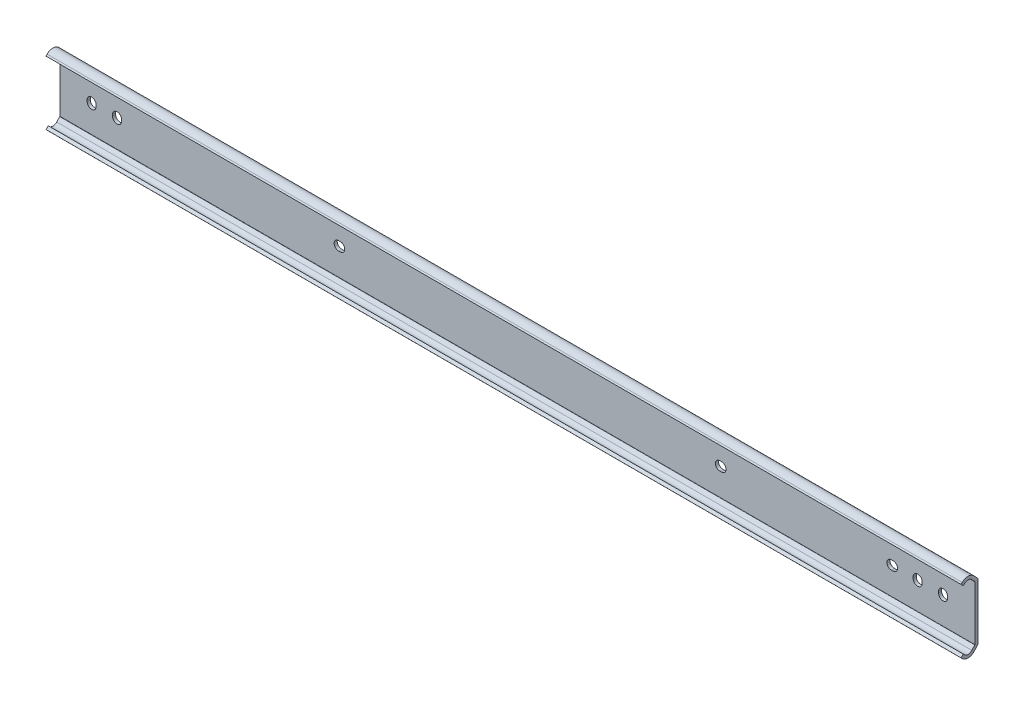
ISO-10303-21;
HEADER;
FILE_DESCRIPTION(('STEP AP214'),'2;1');
FILE_NAME('part.step','',(''),(''),'','','');
FILE_SCHEMA(('AUTOMOTIVE_DESIGN { 1 0 10303 214 1 1 1 1 }'));
ENDSEC;
DATA;
#1=APPLICATION_CONTEXT('core data for automotive mechanical design processes');
#2=APPLICATION_PROTOCOL_DEFINITION('international standard','automotive_design',2000,#1);
#3=PRODUCT_CONTEXT('',#1,'mechanical');
#4=PRODUCT('Part','Part','',(#3));
#5=PRODUCT_RELATED_PRODUCT_CATEGORY('part','',(#4));
#6=PRODUCT_DEFINITION_FORMATION('','',#4);
#7=PRODUCT_DEFINITION_CONTEXT('part definition',#1,'design');
#8=PRODUCT_DEFINITION('design','',#6,#7);
#9=PRODUCT_DEFINITION_SHAPE('','',#8);
#10=(LENGTH_UNIT() NAMED_UNIT(*) SI_UNIT(.MILLI.,.METRE.));
#11=(NAMED_UNIT(*) PLANE_ANGLE_UNIT() SI_UNIT($,.RADIAN.));
#12=(NAMED_UNIT(*) SI_UNIT($,.STERADIAN.) SOLID_ANGLE_UNIT());
#13=UNCERTAINTY_MEASURE_WITH_UNIT(LENGTH_MEASURE(1.E-05),#10,'distance_accuracy_value','');
#14=(GEOMETRIC_REPRESENTATION_CONTEXT(3) GLOBAL_UNCERTAINTY_ASSIGNED_CONTEXT((#13)) GLOBAL_UNIT_ASSIGNED_CONTEXT((#10,
#11,#12)) REPRESENTATION_CONTEXT('',''));
#15=CARTESIAN_POINT('',(0.,0.,0.));
#16=DIRECTION('',(0.,0.,1.));
#17=DIRECTION('',(1.,0.,0.));
#18=AXIS2_PLACEMENT_3D('',#15,#16,#17);
#19=CARTESIAN_POINT('',(-15.9,-13.5610180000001,0.));
#20=DIRECTION('',(0.,0.,-1.));
#21=DIRECTION('',(1.,0.,0.));
#22=AXIS2_PLACEMENT_3D('',#19,#20,#21);
#23=PLANE('',#22);
#24=DIRECTION('',(1.,0.,0.));
#25=VECTOR('',#24,1.);
#26=CARTESIAN_POINT('',(-15.9,13.561018,0.));
#27=LINE('',#26,#25);
#28=CARTESIAN_POINT('',(-15.9,13.561018,0.));
#29=VERTEX_POINT('',#28);
#30=CARTESIAN_POINT('',(441.3,13.561018,0.));
#31=VERTEX_POINT('',#30);
#32=EDGE_CURVE('E667',#29,#31,#27,.T.);
#33=ORIENTED_EDGE('',*,*,#32,.T.);
#34=DIRECTION('',(0.,1.,0.));
#35=VECTOR('',#34,1.);
#36=CARTESIAN_POINT('',(441.3,-13.5610180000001,0.));
#37=LINE('',#36,#35);
#38=CARTESIAN_POINT('',(441.3,-13.5610180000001,0.));
#39=VERTEX_POINT('',#38);
#40=EDGE_CURVE('E601',#39,#31,#37,.T.);
#41=ORIENTED_EDGE('',*,*,#40,.F.);
#42=DIRECTION('',(1.,0.,0.));
#43=VECTOR('',#42,1.);
#44=CARTESIAN_POINT('',(-15.9,-13.5610180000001,0.));
#45=LINE('',#44,#43);
#46=CARTESIAN_POINT('',(-15.9,-13.5610180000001,0.));
#47=VERTEX_POINT('',#46);
#48=EDGE_CURVE('E670',#47,#39,#45,.T.);
#49=ORIENTED_EDGE('',*,*,#48,.F.);
#50=DIRECTION('',(0.,1.,0.));
#51=VECTOR('',#50,1.);
#52=CARTESIAN_POINT('',(-15.9,-13.5610180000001,0.));
#53=LINE('',#52,#51);
#54=EDGE_CURVE('E658',#47,#29,#53,.T.);
#55=ORIENTED_EDGE('',*,*,#54,.T.);
#56=EDGE_LOOP('',(#33,#41,#49,#55));
#57=FACE_BOUND('',#56,.T.);
#58=CARTESIAN_POINT('',(314.7,0.,0.));
#59=DIRECTION('',(0.,0.,-1.));
#60=DIRECTION('',(1.,0.,0.));
#61=AXIS2_PLACEMENT_3D('',#58,#59,#60);
#62=CIRCLE('',#61,2.25);
#63=CARTESIAN_POINT('',(314.7,-2.25000000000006,0.));
#64=VERTEX_POINT('',#63);
#65=CARTESIAN_POINT('',(314.7,2.24999999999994,0.));
#66=VERTEX_POINT('',#65);
#67=EDGE_CURVE('E343',#64,#66,#62,.F.);
#68=ORIENTED_EDGE('',*,*,#67,.T.);
#69=DIRECTION('',(-1.,0.,0.));
#70=VECTOR('',#69,1.);
#71=CARTESIAN_POINT('',(314.7,2.24999999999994,0.));
#72=LINE('',#71,#70);
#73=CARTESIAN_POINT('',(313.9,2.24999999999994,0.));
#74=VERTEX_POINT('',#73);
#75=EDGE_CURVE('E338',#66,#74,#72,.T.);
#76=ORIENTED_EDGE('',*,*,#75,.T.);
#77=CARTESIAN_POINT('',(313.9,0.,0.));
#78=DIRECTION('',(0.,0.,-1.));
#79=DIRECTION('',(1.,0.,0.));
#80=AXIS2_PLACEMENT_3D('',#77,#78,#79);
#81=CIRCLE('',#80,2.25);
#82=CARTESIAN_POINT('',(313.9,-2.25000000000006,0.));
#83=VERTEX_POINT('',#82);
#84=EDGE_CURVE('E351',#74,#83,#81,.F.);
#85=ORIENTED_EDGE('',*,*,#84,.T.);
#86=DIRECTION('',(1.,0.,0.));
#87=VECTOR('',#86,1.);
#88=CARTESIAN_POINT('',(313.9,-2.25000000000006,0.));
#89=LINE('',#88,#87);
#90=EDGE_CURVE('E332',#83,#64,#89,.T.);
#91=ORIENTED_EDGE('',*,*,#90,.T.);
#92=EDGE_LOOP('',(#68,#76,#85,#91));
#93=FACE_BOUND('',#92,.T.);
#94=CARTESIAN_POINT('',(412.7,0.400000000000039,0.));
#95=DIRECTION('',(0.,0.,1.));
#96=DIRECTION('',(1.,0.,0.));
#97=AXIS2_PLACEMENT_3D('',#94,#95,#96);
#98=CIRCLE('',#97,2.24999999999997);
#99=CARTESIAN_POINT('',(414.95,0.400000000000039,0.));
#100=VERTEX_POINT('',#99);
#101=CARTESIAN_POINT('',(410.45,0.400000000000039,0.));
#102=VERTEX_POINT('',#101);
#103=EDGE_CURVE('E531',#100,#102,#98,.T.);
#104=ORIENTED_EDGE('',*,*,#103,.T.);
#105=DIRECTION('',(0.,-1.,0.));
#106=VECTOR('',#105,1.);
#107=CARTESIAN_POINT('',(410.45,0.400000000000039,0.));
#108=LINE('',#107,#106);
#109=CARTESIAN_POINT('',(410.45,-0.400000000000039,0.));
#110=VERTEX_POINT('',#109);
#111=EDGE_CURVE('E534',#102,#110,#108,.T.);
#112=ORIENTED_EDGE('',*,*,#111,.T.);
#113=CARTESIAN_POINT('',(412.7,-0.400000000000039,0.));
#114=DIRECTION('',(0.,0.,1.));
#115=DIRECTION('',(1.,0.,0.));
#116=AXIS2_PLACEMENT_3D('',#113,#114,#115);
#117=CIRCLE('',#116,2.24999999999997);
#118=CARTESIAN_POINT('',(414.95,-0.400000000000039,0.));
#119=VERTEX_POINT('',#118);
#120=EDGE_CURVE('E537',#110,#119,#117,.T.);
#121=ORIENTED_EDGE('',*,*,#120,.T.);
#122=DIRECTION('',(0.,1.,0.));
#123=VECTOR('',#122,1.);
#124=CARTESIAN_POINT('',(414.95,0.400000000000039,0.));
#125=LINE('',#124,#123);
#126=EDGE_CURVE('E540',#119,#100,#125,.T.);
#127=ORIENTED_EDGE('',*,*,#126,.T.);
#128=EDGE_LOOP('',(#104,#112,#121,#127));
#129=FACE_BOUND('',#128,.T.);
#130=CARTESIAN_POINT('',(425.4,0.400000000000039,0.));
#131=DIRECTION('',(0.,0.,1.));
#132=DIRECTION('',(1.,0.,0.));
#133=AXIS2_PLACEMENT_3D('',#130,#131,#132);
#134=CIRCLE('',#133,2.24999999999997);
#135=CARTESIAN_POINT('',(427.65,0.400000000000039,0.));
#136=VERTEX_POINT('',#135);
#137=CARTESIAN_POINT('',(423.15,0.400000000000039,0.));
#138=VERTEX_POINT('',#137);
#139=EDGE_CURVE('E499',#136,#138,#134,.T.);
#140=ORIENTED_EDGE('',*,*,#139,.T.);
#141=DIRECTION('',(0.,-1.,0.));
#142=VECTOR('',#141,1.);
#143=CARTESIAN_POINT('',(423.15,0.400000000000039,0.));
#144=LINE('',#143,#142);
#145=CARTESIAN_POINT('',(423.15,-0.400000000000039,0.));
#146=VERTEX_POINT('',#145);
#147=EDGE_CURVE('E502',#138,#146,#144,.T.);
#148=ORIENTED_EDGE('',*,*,#147,.T.);
#149=CARTESIAN_POINT('',(425.4,-0.400000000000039,0.));
#150=DIRECTION('',(0.,0.,1.));
#151=DIRECTION('',(1.,0.,0.));
#152=AXIS2_PLACEMENT_3D('',#149,#150,#151);
#153=CIRCLE('',#152,2.24999999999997);
#154=CARTESIAN_POINT('',(427.65,-0.400000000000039,0.));
#155=VERTEX_POINT('',#154);
#156=EDGE_CURVE('E505',#146,#155,#153,.T.);
#157=ORIENTED_EDGE('',*,*,#156,.T.);
#158=DIRECTION('',(0.,1.,0.));
#159=VECTOR('',#158,1.);
#160=CARTESIAN_POINT('',(427.65,0.400000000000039,0.));
#161=LINE('',#160,#159);
#162=EDGE_CURVE('E508',#155,#136,#161,.T.);
#163=ORIENTED_EDGE('',*,*,#162,.T.);
#164=EDGE_LOOP('',(#140,#148,#157,#163));
#165=FACE_BOUND('',#164,.T.);
#166=CARTESIAN_POINT('',(12.7,0.400000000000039,0.));
#167=DIRECTION('',(0.,0.,1.));
#168=DIRECTION('',(1.,0.,0.));
#169=AXIS2_PLACEMENT_3D('',#166,#167,#168);
#170=CIRCLE('',#169,2.24999999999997);
#171=CARTESIAN_POINT('',(14.95,0.400000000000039,0.));
#172=VERTEX_POINT('',#171);
#173=CARTESIAN_POINT('',(10.45,0.400000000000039,0.));
#174=VERTEX_POINT('',#173);
#175=EDGE_CURVE('E467',#172,#174,#170,.T.);
#176=ORIENTED_EDGE('',*,*,#175,.T.);
#177=DIRECTION('',(0.,-1.,0.));
#178=VECTOR('',#177,1.);
#179=CARTESIAN_POINT('',(10.45,0.400000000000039,0.));
#180=LINE('',#179,#178);
#181=CARTESIAN_POINT('',(10.45,-0.400000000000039,0.));
#182=VERTEX_POINT('',#181);
#183=EDGE_CURVE('E470',#174,#182,#180,.T.);
#184=ORIENTED_EDGE('',*,*,#183,.T.);
#185=CARTESIAN_POINT('',(12.7,-0.400000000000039,0.));
#186=DIRECTION('',(0.,0.,1.));
#187=DIRECTION('',(1.,0.,0.));
#188=AXIS2_PLACEMENT_3D('',#185,#186,#187);
#189=CIRCLE('',#188,2.24999999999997);
#190=CARTESIAN_POINT('',(14.95,-0.400000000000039,0.));
#191=VERTEX_POINT('',#190);
#192=EDGE_CURVE('E473',#182,#191,#189,.T.);
#193=ORIENTED_EDGE('',*,*,#192,.T.);
#194=DIRECTION('',(0.,1.,0.));
#195=VECTOR('',#194,1.);
#196=CARTESIAN_POINT('',(14.95,0.400000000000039,0.));
#197=LINE('',#196,#195);
#198=EDGE_CURVE('E476',#191,#172,#197,.T.);
#199=ORIENTED_EDGE('',*,*,#198,.T.);
#200=EDGE_LOOP('',(#176,#184,#193,#199));
#201=FACE_BOUND('',#200,.T.);
#202=CARTESIAN_POINT('',(400.4,0.,0.));
#203=DIRECTION('',(0.,0.,1.));
#204=DIRECTION('',(1.,0.,0.));
#205=AXIS2_PLACEMENT_3D('',#202,#203,#204);
#206=CIRCLE('',#205,2.25);
#207=CARTESIAN_POINT('',(400.4,-2.25,0.));
#208=VERTEX_POINT('',#207);
#209=CARTESIAN_POINT('',(400.4,2.25,0.));
#210=VERTEX_POINT('',#209);
#211=EDGE_CURVE('E435',#208,#210,#206,.T.);
#212=ORIENTED_EDGE('',*,*,#211,.T.);
#213=DIRECTION('',(-1.,0.,0.));
#214=VECTOR('',#213,1.);
#215=CARTESIAN_POINT('',(400.4,2.25,0.));
#216=LINE('',#215,#214);
#217=CARTESIAN_POINT('',(399.6,2.25,0.));
#218=VERTEX_POINT('',#217);
#219=EDGE_CURVE('E438',#210,#218,#216,.T.);
#220=ORIENTED_EDGE('',*,*,#219,.T.);
#221=CARTESIAN_POINT('',(399.6,0.,0.));
#222=DIRECTION('',(0.,0.,1.));
#223=DIRECTION('',(1.,0.,0.));
#224=AXIS2_PLACEMENT_3D('',#221,#222,#223);
#225=CIRCLE('',#224,2.25);
#226=CARTESIAN_POINT('',(399.6,-2.25,0.));
#227=VERTEX_POINT('',#226);
#228=EDGE_CURVE('E441',#218,#227,#225,.T.);
#229=ORIENTED_EDGE('',*,*,#228,.T.);
#230=DIRECTION('',(1.,0.,0.));
#231=VECTOR('',#230,1.);
#232=CARTESIAN_POINT('',(400.4,-2.25,0.));
#233=LINE('',#232,#231);
#234=EDGE_CURVE('E444',#227,#208,#233,.T.);
#235=ORIENTED_EDGE('',*,*,#234,.T.);
#236=EDGE_LOOP('',(#212,#220,#229,#235));
#237=FACE_BOUND('',#236,.T.);
#238=CARTESIAN_POINT('',(0.,0.400000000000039,0.));
#239=DIRECTION('',(0.,0.,1.));
#240=DIRECTION('',(1.,0.,0.));
#241=AXIS2_PLACEMENT_3D('',#238,#239,#240);
#242=CIRCLE('',#241,2.24999999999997);
#243=CARTESIAN_POINT('',(2.25000000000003,0.400000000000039,0.));
#244=VERTEX_POINT('',#243);
#245=CARTESIAN_POINT('',(-2.24999999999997,0.400000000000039,0.));
#246=VERTEX_POINT('',#245);
#247=EDGE_CURVE('E403',#244,#246,#242,.T.);
#248=ORIENTED_EDGE('',*,*,#247,.T.);
#249=DIRECTION('',(0.,-1.,0.));
#250=VECTOR('',#249,1.);
#251=CARTESIAN_POINT('',(-2.24999999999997,0.400000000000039,0.));
#252=LINE('',#251,#250);
#253=CARTESIAN_POINT('',(-2.24999999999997,-0.400000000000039,0.));
#254=VERTEX_POINT('',#253);
#255=EDGE_CURVE('E406',#246,#254,#252,.T.);
#256=ORIENTED_EDGE('',*,*,#255,.T.);
#257=CARTESIAN_POINT('',(0.,-0.400000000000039,0.));
#258=DIRECTION('',(0.,0.,1.));
#259=DIRECTION('',(1.,0.,0.));
#260=AXIS2_PLACEMENT_3D('',#257,#258,#259);
#261=CIRCLE('',#260,2.24999999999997);
#262=CARTESIAN_POINT('',(2.25000000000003,-0.400000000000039,0.));
#263=VERTEX_POINT('',#262);
#264=EDGE_CURVE('E409',#254,#263,#261,.T.);
#265=ORIENTED_EDGE('',*,*,#264,.T.);
#266=DIRECTION('',(0.,1.,0.));
#267=VECTOR('',#266,1.);
#268=CARTESIAN_POINT('',(2.25000000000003,0.400000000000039,0.));
#269=LINE('',#268,#267);
#270=EDGE_CURVE('E412',#263,#244,#269,.T.);
#271=ORIENTED_EDGE('',*,*,#270,.T.);
#272=EDGE_LOOP('',(#248,#256,#265,#271));
#273=FACE_BOUND('',#272,.T.);
#274=CARTESIAN_POINT('',(124.2,0.,0.));
#275=DIRECTION('',(0.,0.,1.));
#276=DIRECTION('',(1.,0.,0.));
#277=AXIS2_PLACEMENT_3D('',#274,#275,#276);
#278=CIRCLE('',#277,2.25);
#279=CARTESIAN_POINT('',(124.2,-2.24999999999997,0.));
#280=VERTEX_POINT('',#279);
#281=CARTESIAN_POINT('',(124.2,2.25000000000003,0.));
#282=VERTEX_POINT('',#281);
#283=EDGE_CURVE('E374',#280,#282,#278,.T.);
#284=ORIENTED_EDGE('',*,*,#283,.T.);
#285=DIRECTION('',(-1.,0.,0.));
#286=VECTOR('',#285,1.);
#287=CARTESIAN_POINT('',(124.2,2.25000000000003,0.));
#288=LINE('',#287,#286);
#289=CARTESIAN_POINT('',(123.4,2.25000000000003,0.));
#290=VERTEX_POINT('',#289);
#291=EDGE_CURVE('E377',#282,#290,#288,.T.);
#292=ORIENTED_EDGE('',*,*,#291,.T.);
#293=CARTESIAN_POINT('',(123.4,0.,0.));
#294=DIRECTION('',(0.,0.,1.));
#295=DIRECTION('',(1.,0.,0.));
#296=AXIS2_PLACEMENT_3D('',#293,#294,#295);
#297=CIRCLE('',#296,2.25);
#298=CARTESIAN_POINT('',(123.4,-2.24999999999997,0.));
#299=VERTEX_POINT('',#298);
#300=EDGE_CURVE('E31',#290,#299,#297,.T.);
#301=ORIENTED_EDGE('',*,*,#300,.T.);
#302=DIRECTION('',(1.,0.,0.));
#303=VECTOR('',#302,1.);
#304=CARTESIAN_POINT('',(124.2,-2.24999999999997,0.));
#305=LINE('',#304,#303);
#306=EDGE_CURVE('E381',#299,#280,#305,.T.);
#307=ORIENTED_EDGE('',*,*,#306,.T.);
#308=EDGE_LOOP('',(#284,#292,#301,#307));
#309=FACE_BOUND('',#308,.T.);
#310=ADVANCED_FACE('F14',(#57,#93,#129,#165,#201,#237,#273,#309),#23,.T.);
#311=CARTESIAN_POINT('',(-15.9,13.561018,1.54999999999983));
#312=DIRECTION('',(0.,0.,1.));
#313=DIRECTION('',(-1.,0.,0.));
#314=AXIS2_PLACEMENT_3D('',#311,#312,#313);
#315=PLANE('',#314);
#316=DIRECTION('',(1.,0.,0.));
#317=VECTOR('',#316,1.);
#318=CARTESIAN_POINT('',(-15.9,-13.5610180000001,1.54999999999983));
#319=LINE('',#318,#317);
#320=CARTESIAN_POINT('',(-15.9,-13.5610180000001,1.54999999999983));
#321=VERTEX_POINT('',#320);
#322=CARTESIAN_POINT('',(441.3,-13.5610180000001,1.54999999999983));
#323=VERTEX_POINT('',#322);
#324=EDGE_CURVE('E689',#321,#323,#319,.T.);
#325=ORIENTED_EDGE('',*,*,#324,.T.);
#326=DIRECTION('',(0.,-1.,0.));
#327=VECTOR('',#326,1.);
#328=CARTESIAN_POINT('',(441.3,13.561018,1.54999999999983));
#329=LINE('',#328,#327);
#330=CARTESIAN_POINT('',(441.3,13.561018,1.54999999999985));
#331=VERTEX_POINT('',#330);
#332=EDGE_CURVE('E573',#331,#323,#329,.T.);
#333=ORIENTED_EDGE('',*,*,#332,.F.);
#334=DIRECTION('',(1.,0.,0.));
#335=VECTOR('',#334,1.);
#336=CARTESIAN_POINT('',(-15.9,13.561018,1.54999999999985));
#337=LINE('',#336,#335);
#338=CARTESIAN_POINT('',(-15.9,13.561018,1.54999999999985));
#339=VERTEX_POINT('',#338);
#340=EDGE_CURVE('E692',#339,#331,#337,.T.);
#341=ORIENTED_EDGE('',*,*,#340,.F.);
#342=DIRECTION('',(0.,-1.,0.));
#343=VECTOR('',#342,1.);
#344=CARTESIAN_POINT('',(-15.9,13.561018,1.54999999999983));
#345=LINE('',#344,#343);
#346=EDGE_CURVE('E629',#339,#321,#345,.T.);
#347=ORIENTED_EDGE('',*,*,#346,.T.);
#348=EDGE_LOOP('',(#325,#333,#341,#347));
#349=FACE_BOUND('',#348,.T.);
#350=DIRECTION('',(-1.,0.,0.));
#351=VECTOR('',#350,1.);
#352=CARTESIAN_POINT('',(314.7,2.24999999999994,1.54999999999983));
#353=LINE('',#352,#351);
#354=CARTESIAN_POINT('',(314.7,2.24999999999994,1.54999999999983));
#355=VERTEX_POINT('',#354);
#356=CARTESIAN_POINT('',(313.9,2.24999999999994,1.54999999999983));
#357=VERTEX_POINT('',#356);
#358=EDGE_CURVE('E322',#355,#357,#353,.T.);
#359=ORIENTED_EDGE('',*,*,#358,.F.);
#360=CARTESIAN_POINT('',(314.7,0.,1.54999999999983));
#361=DIRECTION('',(0.,0.,1.));
#362=DIRECTION('',(-1.,0.,0.));
#363=AXIS2_PLACEMENT_3D('',#360,#361,#362);
#364=CIRCLE('',#363,2.25);
#365=CARTESIAN_POINT('',(314.7,-2.25000000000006,1.54999999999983));
#366=VERTEX_POINT('',#365);
#367=EDGE_CURVE('E328',#366,#355,#364,.T.);
#368=ORIENTED_EDGE('',*,*,#367,.F.);
#369=DIRECTION('',(1.,0.,0.));
#370=VECTOR('',#369,1.);
#371=CARTESIAN_POINT('',(313.9,-2.25000000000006,1.54999999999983));
#372=LINE('',#371,#370);
#373=CARTESIAN_POINT('',(313.9,-2.25000000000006,1.54999999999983));
#374=VERTEX_POINT('',#373);
#375=EDGE_CURVE('E357',#374,#366,#372,.T.);
#376=ORIENTED_EDGE('',*,*,#375,.F.);
#377=CARTESIAN_POINT('',(313.9,0.,1.54999999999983));
#378=DIRECTION('',(0.,0.,1.));
#379=DIRECTION('',(-1.,0.,0.));
#380=AXIS2_PLACEMENT_3D('',#377,#378,#379);
#381=CIRCLE('',#380,2.25);
#382=EDGE_CURVE('E330',#357,#374,#381,.T.);
#383=ORIENTED_EDGE('',*,*,#382,.F.);
#384=EDGE_LOOP('',(#359,#368,#376,#383));
#385=FACE_BOUND('',#384,.T.);
#386=CARTESIAN_POINT('',(412.7,0.400000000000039,1.54999999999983));
#387=DIRECTION('',(0.,0.,1.));
#388=DIRECTION('',(1.,0.,0.));
#389=AXIS2_PLACEMENT_3D('',#386,#387,#388);
#390=CIRCLE('',#389,2.24999999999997);
#391=CARTESIAN_POINT('',(414.95,0.400000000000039,1.54999999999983));
#392=VERTEX_POINT('',#391);
#393=CARTESIAN_POINT('',(410.45,0.400000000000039,1.54999999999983));
#394=VERTEX_POINT('',#393);
#395=EDGE_CURVE('E514',#392,#394,#390,.T.);
#396=ORIENTED_EDGE('',*,*,#395,.F.);
#397=DIRECTION('',(0.,1.,0.));
#398=VECTOR('',#397,1.);
#399=CARTESIAN_POINT('',(414.95,0.400000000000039,1.54999999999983));
#400=LINE('',#399,#398);
#401=CARTESIAN_POINT('',(414.95,-0.400000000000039,1.54999999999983));
#402=VERTEX_POINT('',#401);
#403=EDGE_CURVE('E528',#402,#392,#400,.T.);
#404=ORIENTED_EDGE('',*,*,#403,.F.);
#405=CARTESIAN_POINT('',(412.7,-0.400000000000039,1.54999999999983));
#406=DIRECTION('',(0.,0.,1.));
#407=DIRECTION('',(1.,0.,0.));
#408=AXIS2_PLACEMENT_3D('',#405,#406,#407);
#409=CIRCLE('',#408,2.24999999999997);
#410=CARTESIAN_POINT('',(410.45,-0.40000000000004,1.54999999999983));
#411=VERTEX_POINT('',#410);
#412=EDGE_CURVE('E525',#411,#402,#409,.T.);
#413=ORIENTED_EDGE('',*,*,#412,.F.);
#414=DIRECTION('',(0.,-1.,0.));
#415=VECTOR('',#414,1.);
#416=CARTESIAN_POINT('',(410.45,0.400000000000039,1.54999999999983));
#417=LINE('',#416,#415);
#418=EDGE_CURVE('E522',#394,#411,#417,.T.);
#419=ORIENTED_EDGE('',*,*,#418,.F.);
#420=EDGE_LOOP('',(#396,#404,#413,#419));
#421=FACE_BOUND('',#420,.T.);
#422=CARTESIAN_POINT('',(425.4,0.400000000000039,1.54999999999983));
#423=DIRECTION('',(0.,0.,1.));
#424=DIRECTION('',(1.,0.,0.));
#425=AXIS2_PLACEMENT_3D('',#422,#423,#424);
#426=CIRCLE('',#425,2.24999999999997);
#427=CARTESIAN_POINT('',(427.65,0.400000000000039,1.54999999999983));
#428=VERTEX_POINT('',#427);
#429=CARTESIAN_POINT('',(423.15,0.400000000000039,1.54999999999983));
#430=VERTEX_POINT('',#429);
#431=EDGE_CURVE('E482',#428,#430,#426,.T.);
#432=ORIENTED_EDGE('',*,*,#431,.F.);
#433=DIRECTION('',(0.,1.,0.));
#434=VECTOR('',#433,1.);
#435=CARTESIAN_POINT('',(427.65,0.400000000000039,1.54999999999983));
#436=LINE('',#435,#434);
#437=CARTESIAN_POINT('',(427.65,-0.400000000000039,1.54999999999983));
#438=VERTEX_POINT('',#437);
#439=EDGE_CURVE('E496',#438,#428,#436,.T.);
#440=ORIENTED_EDGE('',*,*,#439,.F.);
#441=CARTESIAN_POINT('',(425.4,-0.400000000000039,1.54999999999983));
#442=DIRECTION('',(0.,0.,1.));
#443=DIRECTION('',(1.,0.,0.));
#444=AXIS2_PLACEMENT_3D('',#441,#442,#443);
#445=CIRCLE('',#444,2.24999999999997);
#446=CARTESIAN_POINT('',(423.15,-0.40000000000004,1.54999999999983));
#447=VERTEX_POINT('',#446);
#448=EDGE_CURVE('E493',#447,#438,#445,.T.);
#449=ORIENTED_EDGE('',*,*,#448,.F.);
#450=DIRECTION('',(0.,-1.,0.));
#451=VECTOR('',#450,1.);
#452=CARTESIAN_POINT('',(423.15,0.400000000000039,1.54999999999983));
#453=LINE('',#452,#451);
#454=EDGE_CURVE('E490',#430,#447,#453,.T.);
#455=ORIENTED_EDGE('',*,*,#454,.F.);
#456=EDGE_LOOP('',(#432,#440,#449,#455));
#457=FACE_BOUND('',#456,.T.);
#458=CARTESIAN_POINT('',(12.7,0.400000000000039,1.54999999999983));
#459=DIRECTION('',(0.,0.,1.));
#460=DIRECTION('',(1.,0.,0.));
#461=AXIS2_PLACEMENT_3D('',#458,#459,#460);
#462=CIRCLE('',#461,2.24999999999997);
#463=CARTESIAN_POINT('',(14.95,0.400000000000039,1.54999999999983));
#464=VERTEX_POINT('',#463);
#465=CARTESIAN_POINT('',(10.45,0.400000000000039,1.54999999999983));
#466=VERTEX_POINT('',#465);
#467=EDGE_CURVE('E450',#464,#466,#462,.T.);
#468=ORIENTED_EDGE('',*,*,#467,.F.);
#469=DIRECTION('',(0.,1.,0.));
#470=VECTOR('',#469,1.);
#471=CARTESIAN_POINT('',(14.95,0.400000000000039,1.54999999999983));
#472=LINE('',#471,#470);
#473=CARTESIAN_POINT('',(14.95,-0.400000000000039,1.54999999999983));
#474=VERTEX_POINT('',#473);
#475=EDGE_CURVE('E464',#474,#464,#472,.T.);
#476=ORIENTED_EDGE('',*,*,#475,.F.);
#477=CARTESIAN_POINT('',(12.7,-0.400000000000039,1.54999999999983));
#478=DIRECTION('',(0.,0.,1.));
#479=DIRECTION('',(1.,0.,0.));
#480=AXIS2_PLACEMENT_3D('',#477,#478,#479);
#481=CIRCLE('',#480,2.24999999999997);
#482=CARTESIAN_POINT('',(10.45,-0.40000000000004,1.54999999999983));
#483=VERTEX_POINT('',#482);
#484=EDGE_CURVE('E461',#483,#474,#481,.T.);
#485=ORIENTED_EDGE('',*,*,#484,.F.);
#486=DIRECTION('',(0.,-1.,0.));
#487=VECTOR('',#486,1.);
#488=CARTESIAN_POINT('',(10.45,0.400000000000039,1.54999999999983));
#489=LINE('',#488,#487);
#490=EDGE_CURVE('E458',#466,#483,#489,.T.);
#491=ORIENTED_EDGE('',*,*,#490,.F.);
#492=EDGE_LOOP('',(#468,#476,#485,#491));
#493=FACE_BOUND('',#492,.T.);
#494=CARTESIAN_POINT('',(400.4,0.,1.54999999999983));
#495=DIRECTION('',(0.,0.,1.));
#496=DIRECTION('',(1.,0.,0.));
#497=AXIS2_PLACEMENT_3D('',#494,#495,#496);
#498=CIRCLE('',#497,2.25);
#499=CARTESIAN_POINT('',(400.4,-2.25,1.54999999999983));
#500=VERTEX_POINT('',#499);
#501=CARTESIAN_POINT('',(400.4,2.25,1.54999999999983));
#502=VERTEX_POINT('',#501);
#503=EDGE_CURVE('E418',#500,#502,#498,.T.);
#504=ORIENTED_EDGE('',*,*,#503,.F.);
#505=DIRECTION('',(1.,0.,0.));
#506=VECTOR('',#505,1.);
#507=CARTESIAN_POINT('',(400.4,-2.25,1.54999999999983));
#508=LINE('',#507,#506);
#509=CARTESIAN_POINT('',(399.6,-2.25,1.54999999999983));
#510=VERTEX_POINT('',#509);
#511=EDGE_CURVE('E432',#510,#500,#508,.T.);
#512=ORIENTED_EDGE('',*,*,#511,.F.);
#513=CARTESIAN_POINT('',(399.6,0.,1.54999999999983));
#514=DIRECTION('',(0.,0.,1.));
#515=DIRECTION('',(1.,0.,0.));
#516=AXIS2_PLACEMENT_3D('',#513,#514,#515);
#517=CIRCLE('',#516,2.25);
#518=CARTESIAN_POINT('',(399.6,2.25,1.54999999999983));
#519=VERTEX_POINT('',#518);
#520=EDGE_CURVE('E429',#519,#510,#517,.T.);
#521=ORIENTED_EDGE('',*,*,#520,.F.);
#522=DIRECTION('',(-1.,0.,0.));
#523=VECTOR('',#522,1.);
#524=CARTESIAN_POINT('',(400.4,2.25,1.54999999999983));
#525=LINE('',#524,#523);
#526=EDGE_CURVE('E426',#502,#519,#525,.T.);
#527=ORIENTED_EDGE('',*,*,#526,.F.);
#528=EDGE_LOOP('',(#504,#512,#521,#527));
#529=FACE_BOUND('',#528,.T.);
#530=CARTESIAN_POINT('',(0.,0.400000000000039,1.54999999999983));
#531=DIRECTION('',(0.,0.,1.));
#532=DIRECTION('',(1.,0.,0.));
#533=AXIS2_PLACEMENT_3D('',#530,#531,#532);
#534=CIRCLE('',#533,2.24999999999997);
#535=CARTESIAN_POINT('',(2.25000000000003,0.400000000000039,1.54999999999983));
#536=VERTEX_POINT('',#535);
#537=CARTESIAN_POINT('',(-2.24999999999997,0.400000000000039,1.54999999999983));
#538=VERTEX_POINT('',#537);
#539=EDGE_CURVE('E387',#536,#538,#534,.T.);
#540=ORIENTED_EDGE('',*,*,#539,.F.);
#541=DIRECTION('',(0.,1.,0.));
#542=VECTOR('',#541,1.);
#543=CARTESIAN_POINT('',(2.25000000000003,0.400000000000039,1.54999999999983));
#544=LINE('',#543,#542);
#545=CARTESIAN_POINT('',(2.25000000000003,-0.400000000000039,1.54999999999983));
#546=VERTEX_POINT('',#545);
#547=EDGE_CURVE('E400',#546,#536,#544,.T.);
#548=ORIENTED_EDGE('',*,*,#547,.F.);
#549=CARTESIAN_POINT('',(0.,-0.400000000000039,1.54999999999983));
#550=DIRECTION('',(0.,0.,1.));
#551=DIRECTION('',(1.,0.,0.));
#552=AXIS2_PLACEMENT_3D('',#549,#550,#551);
#553=CIRCLE('',#552,2.24999999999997);
#554=CARTESIAN_POINT('',(-2.24999999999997,-0.40000000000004,1.54999999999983));
#555=VERTEX_POINT('',#554);
#556=EDGE_CURVE('E397',#555,#546,#553,.T.);
#557=ORIENTED_EDGE('',*,*,#556,.F.);
#558=DIRECTION('',(0.,-1.,0.));
#559=VECTOR('',#558,1.);
#560=CARTESIAN_POINT('',(-2.24999999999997,0.400000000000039,1.54999999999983));
#561=LINE('',#560,#559);
#562=EDGE_CURVE('E394',#538,#555,#561,.T.);
#563=ORIENTED_EDGE('',*,*,#562,.F.);
#564=EDGE_LOOP('',(#540,#548,#557,#563));
#565=FACE_BOUND('',#564,.T.);
#566=CARTESIAN_POINT('',(124.2,0.,1.54999999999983));
#567=DIRECTION('',(0.,0.,1.));
#568=DIRECTION('',(1.,0.,0.));
#569=AXIS2_PLACEMENT_3D('',#566,#567,#568);
#570=CIRCLE('',#569,2.25);
#571=CARTESIAN_POINT('',(124.2,-2.24999999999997,1.54999999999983));
#572=VERTEX_POINT('',#571);
#573=CARTESIAN_POINT('',(124.2,2.25000000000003,1.54999999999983));
#574=VERTEX_POINT('',#573);
#575=EDGE_CURVE('E39',#572,#574,#570,.T.);
#576=ORIENTED_EDGE('',*,*,#575,.F.);
#577=DIRECTION('',(1.,0.,0.));
#578=VECTOR('',#577,1.);
#579=CARTESIAN_POINT('',(124.2,-2.24999999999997,1.54999999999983));
#580=LINE('',#579,#578);
#581=CARTESIAN_POINT('',(123.4,-2.24999999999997,1.54999999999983));
#582=VERTEX_POINT('',#581);
#583=EDGE_CURVE('E371',#582,#572,#580,.T.);
#584=ORIENTED_EDGE('',*,*,#583,.F.);
#585=CARTESIAN_POINT('',(123.4,0.,1.54999999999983));
#586=DIRECTION('',(0.,0.,1.));
#587=DIRECTION('',(1.,0.,0.));
#588=AXIS2_PLACEMENT_3D('',#585,#586,#587);
#589=CIRCLE('',#588,2.25);
#590=CARTESIAN_POINT('',(123.4,2.25000000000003,1.54999999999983));
#591=VERTEX_POINT('',#590);
#592=EDGE_CURVE('E368',#591,#582,#589,.T.);
#593=ORIENTED_EDGE('',*,*,#592,.F.);
#594=DIRECTION('',(-1.,0.,0.));
#595=VECTOR('',#594,1.);
#596=CARTESIAN_POINT('',(124.2,2.25000000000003,1.54999999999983));
#597=LINE('',#596,#595);
#598=EDGE_CURVE('E365',#574,#591,#597,.T.);
#599=ORIENTED_EDGE('',*,*,#598,.F.);
#600=EDGE_LOOP('',(#576,#584,#593,#599));
#601=FACE_BOUND('',#600,.T.);
#602=ADVANCED_FACE('F324',(#349,#385,#421,#457,#493,#529,#565,#601),#315,.T.);
#603=CARTESIAN_POINT('',(441.3,13.575,5.00000000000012));
#604=DIRECTION('',(-1.,0.,0.));
#605=DIRECTION('',(0.,0.,-1.));
#606=AXIS2_PLACEMENT_3D('',#603,#604,#605);
#607=PLANE('',#606);
#608=ORIENTED_EDGE('',*,*,#40,.T.);
#609=CARTESIAN_POINT('',(441.3,13.5610179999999,1.80000000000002));
#610=DIRECTION('',(1.,0.,0.));
#611=DIRECTION('',(0.,0.,-1.));
#612=AXIS2_PLACEMENT_3D('',#609,#610,#611);
#613=CIRCLE('',#612,1.8);
#614=CARTESIAN_POINT('',(441.3,14.8073560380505,0.501292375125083));
#615=VERTEX_POINT('',#614);
#616=EDGE_CURVE('E603',#31,#615,#613,.T.);
#617=ORIENTED_EDGE('',*,*,#616,.T.);
#618=DIRECTION('',(0.,0.721504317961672,0.692409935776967));
#619=VECTOR('',#618,1.);
#620=CARTESIAN_POINT('',(441.3,14.8073560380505,0.501292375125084));
#621=LINE('',#620,#619);
#622=CARTESIAN_POINT('',(441.3,16.4741282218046,2.10085261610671));
#623=VERTEX_POINT('',#622);
#624=EDGE_CURVE('E606',#615,#623,#621,.T.);
#625=ORIENTED_EDGE('',*,*,#624,.T.);
#626=CARTESIAN_POINT('',(441.3,13.575,5.00000000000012));
#627=DIRECTION('',(1.,0.,0.));
#628=DIRECTION('',(0.,0.,-1.));
#629=AXIS2_PLACEMENT_3D('',#626,#627,#628);
#630=CIRCLE('',#629,4.1);
#631=CARTESIAN_POINT('',(441.3,16.4741282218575,7.89914738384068));
#632=VERTEX_POINT('',#631);
#633=EDGE_CURVE('E546',#623,#632,#630,.T.);
#634=ORIENTED_EDGE('',*,*,#633,.T.);
#635=DIRECTION('',(0.,-0.721504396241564,0.692409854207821));
#636=VECTOR('',#635,1.);
#637=CARTESIAN_POINT('',(441.3,15.8897090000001,8.45999999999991));
#638=LINE('',#637,#636);
#639=CARTESIAN_POINT('',(441.3,15.8897090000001,8.45999999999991));
#640=VERTEX_POINT('',#639);
#641=EDGE_CURVE('E555',#632,#640,#638,.T.);
#642=ORIENTED_EDGE('',*,*,#641,.T.);
#643=DIRECTION('',(0.,-0.707106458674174,-0.707107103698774));
#644=VECTOR('',#643,1.);
#645=CARTESIAN_POINT('',(441.3,14.793462,7.363752));
#646=LINE('',#645,#644);
#647=CARTESIAN_POINT('',(441.3,14.793462,7.363752));
#648=VERTEX_POINT('',#647);
#649=EDGE_CURVE('E558',#640,#648,#646,.T.);
#650=ORIENTED_EDGE('',*,*,#649,.T.);
#651=DIRECTION('',(0.,0.721503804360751,-0.692410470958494));
#652=VECTOR('',#651,1.);
#653=CARTESIAN_POINT('',(441.3,15.3880487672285,6.79314086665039));
#654=LINE('',#653,#652);
#655=CARTESIAN_POINT('',(441.3,15.3880487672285,6.79314086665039));
#656=VERTEX_POINT('',#655);
#657=EDGE_CURVE('E561',#648,#656,#654,.T.);
#658=ORIENTED_EDGE('',*,*,#657,.T.);
#659=CARTESIAN_POINT('',(441.3,13.575,5.00000000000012));
#660=DIRECTION('',(-1.,0.,0.));
#661=DIRECTION('',(0.,0.,1.));
#662=AXIS2_PLACEMENT_3D('',#659,#660,#661);
#663=CIRCLE('',#662,2.55);
#664=CARTESIAN_POINT('',(441.3,15.2920682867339,3.11474762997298));
#665=VERTEX_POINT('',#664);
#666=EDGE_CURVE('E564',#656,#665,#663,.T.);
#667=ORIENTED_EDGE('',*,*,#666,.T.);
#668=DIRECTION('',(0.,-0.721504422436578,-0.692409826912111));
#669=VECTOR('',#668,1.);
#670=CARTESIAN_POINT('',(441.3,13.7341205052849,1.61962394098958));
#671=LINE('',#670,#669);
#672=CARTESIAN_POINT('',(441.3,13.7341205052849,1.61962394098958));
#673=VERTEX_POINT('',#672);
#674=EDGE_CURVE('E567',#665,#673,#671,.T.);
#675=ORIENTED_EDGE('',*,*,#674,.T.);
#676=CARTESIAN_POINT('',(441.3,13.5610179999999,1.80000000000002));
#677=DIRECTION('',(-1.,0.,0.));
#678=DIRECTION('',(0.,0.,1.));
#679=AXIS2_PLACEMENT_3D('',#676,#677,#678);
#680=CIRCLE('',#679,0.250000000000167);
#681=EDGE_CURVE('E570',#673,#331,#680,.T.);
#682=ORIENTED_EDGE('',*,*,#681,.T.);
#683=ORIENTED_EDGE('',*,*,#332,.T.);
#684=CARTESIAN_POINT('',(441.3,-13.561018,1.80000000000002));
#685=DIRECTION('',(-1.,0.,0.));
#686=DIRECTION('',(0.,0.,-1.));
#687=AXIS2_PLACEMENT_3D('',#684,#685,#686);
#688=CIRCLE('',#687,0.250000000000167);
#689=CARTESIAN_POINT('',(441.3,-13.734120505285,1.61962394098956));
#690=VERTEX_POINT('',#689);
#691=EDGE_CURVE('E575',#323,#690,#688,.T.);
#692=ORIENTED_EDGE('',*,*,#691,.T.);
#693=DIRECTION('',(0.,-0.721504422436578,0.692409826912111));
#694=VECTOR('',#693,1.);
#695=CARTESIAN_POINT('',(441.3,-13.734120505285,1.61962394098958));
#696=LINE('',#695,#694);
#697=CARTESIAN_POINT('',(441.3,-15.292068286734,3.11474762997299));
#698=VERTEX_POINT('',#697);
#699=EDGE_CURVE('E578',#690,#698,#696,.T.);
#700=ORIENTED_EDGE('',*,*,#699,.T.);
#701=CARTESIAN_POINT('',(441.3,-13.5750000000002,5.00000000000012));
#702=DIRECTION('',(-1.,0.,0.));
#703=DIRECTION('',(0.,0.,-1.));
#704=AXIS2_PLACEMENT_3D('',#701,#702,#703);
#705=CIRCLE('',#704,2.55);
#706=CARTESIAN_POINT('',(441.3,-15.3880487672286,6.79314086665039));
#707=VERTEX_POINT('',#706);
#708=EDGE_CURVE('E581',#698,#707,#705,.T.);
#709=ORIENTED_EDGE('',*,*,#708,.T.);
#710=DIRECTION('',(0.,0.721503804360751,0.692410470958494));
#711=VECTOR('',#710,1.);
#712=CARTESIAN_POINT('',(441.3,-15.3880487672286,6.79314086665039));
#713=LINE('',#712,#711);
#714=CARTESIAN_POINT('',(441.3,-14.7934620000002,7.363752));
#715=VERTEX_POINT('',#714);
#716=EDGE_CURVE('E584',#707,#715,#713,.T.);
#717=ORIENTED_EDGE('',*,*,#716,.T.);
#718=DIRECTION('',(0.,-0.707106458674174,0.707107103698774));
#719=VECTOR('',#718,1.);
#720=CARTESIAN_POINT('',(441.3,-14.7934620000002,7.363752));
#721=LINE('',#720,#719);
#722=CARTESIAN_POINT('',(441.3,-15.8897090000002,8.45999999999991));
#723=VERTEX_POINT('',#722);
#724=EDGE_CURVE('E587',#715,#723,#721,.T.);
#725=ORIENTED_EDGE('',*,*,#724,.T.);
#726=DIRECTION('',(0.,-0.721504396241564,-0.692409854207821));
#727=VECTOR('',#726,1.);
#728=CARTESIAN_POINT('',(441.3,-15.8897090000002,8.45999999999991));
#729=LINE('',#728,#727);
#730=CARTESIAN_POINT('',(441.3,-16.4741282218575,7.89914738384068));
#731=VERTEX_POINT('',#730);
#732=EDGE_CURVE('E590',#723,#731,#729,.T.);
#733=ORIENTED_EDGE('',*,*,#732,.T.);
#734=CARTESIAN_POINT('',(441.3,-13.5750000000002,5.00000000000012));
#735=DIRECTION('',(1.,0.,0.));
#736=DIRECTION('',(0.,0.,1.));
#737=AXIS2_PLACEMENT_3D('',#734,#735,#736);
#738=CIRCLE('',#737,4.1);
#739=CARTESIAN_POINT('',(441.3,-16.4741282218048,2.10085261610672));
#740=VERTEX_POINT('',#739);
#741=EDGE_CURVE('E593',#731,#740,#738,.T.);
#742=ORIENTED_EDGE('',*,*,#741,.T.);
#743=DIRECTION('',(0.,0.721504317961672,-0.692409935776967));
#744=VECTOR('',#743,1.);
#745=CARTESIAN_POINT('',(441.3,-14.8073560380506,0.501292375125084));
#746=LINE('',#745,#744);
#747=CARTESIAN_POINT('',(441.3,-14.8073560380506,0.501292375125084));
#748=VERTEX_POINT('',#747);
#749=EDGE_CURVE('E596',#740,#748,#746,.T.);
#750=ORIENTED_EDGE('',*,*,#749,.T.);
#751=CARTESIAN_POINT('',(441.3,-13.561018,1.80000000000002));
#752=DIRECTION('',(1.,0.,0.));
#753=DIRECTION('',(0.,0.,1.));
#754=AXIS2_PLACEMENT_3D('',#751,#752,#753);
#755=CIRCLE('',#754,1.8);
#756=EDGE_CURVE('E598',#748,#39,#755,.T.);
#757=ORIENTED_EDGE('',*,*,#756,.T.);
#758=EDGE_LOOP('',(#608,#617,#625,#634,#642,#650,#658,#667,#675,#682,#683,#692,#700,#709,#717,
#725,#733,#742,#750,#757));
#759=FACE_BOUND('',#758,.T.);
#760=ADVANCED_FACE('F712',(#759),#607,.F.);
#761=CARTESIAN_POINT('',(-15.9,13.575,5.00000000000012));
#762=DIRECTION('',(1.,0.,0.));
#763=DIRECTION('',(0.,0.,1.));
#764=AXIS2_PLACEMENT_3D('',#761,#762,#763);
#765=CYLINDRICAL_SURFACE('',#764,4.1);
#766=ORIENTED_EDGE('',*,*,#633,.F.);
#767=DIRECTION('',(1.,0.,0.));
#768=VECTOR('',#767,1.);
#769=CARTESIAN_POINT('',(-15.9,16.4741282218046,2.10085261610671));
#770=LINE('',#769,#768);
#771=CARTESIAN_POINT('',(-15.9,16.4741282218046,2.10085261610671));
#772=VERTEX_POINT('',#771);
#773=EDGE_CURVE('E9',#772,#623,#770,.T.);
#774=ORIENTED_EDGE('',*,*,#773,.F.);
#775=CARTESIAN_POINT('',(-15.9,13.575,5.00000000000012));
#776=DIRECTION('',(1.,0.,0.));
#777=DIRECTION('',(0.,0.,-1.));
#778=AXIS2_PLACEMENT_3D('',#775,#776,#777);
#779=CIRCLE('',#778,4.1);
#780=CARTESIAN_POINT('',(-15.9,16.4741282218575,7.89914738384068));
#781=VERTEX_POINT('',#780);
#782=EDGE_CURVE('E608',#772,#781,#779,.T.);
#783=ORIENTED_EDGE('',*,*,#782,.T.);
#784=DIRECTION('',(1.,0.,0.));
#785=VECTOR('',#784,1.);
#786=CARTESIAN_POINT('',(-15.9,16.4741282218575,7.89914738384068));
#787=LINE('',#786,#785);
#788=EDGE_CURVE('E18',#781,#632,#787,.T.);
#789=ORIENTED_EDGE('',*,*,#788,.T.);
#790=EDGE_LOOP('',(#766,#774,#783,#789));
#791=FACE_BOUND('',#790,.T.);
#792=ADVANCED_FACE('F16',(#791),#765,.T.);
#793=CARTESIAN_POINT('',(-15.9,14.8073560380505,0.501292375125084));
#794=DIRECTION('',(0.,0.692409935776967,-0.721504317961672));
#795=DIRECTION('',(0.,0.721504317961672,0.692409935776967));
#796=AXIS2_PLACEMENT_3D('',#793,#794,#795);
#797=PLANE('',#796);
#798=ORIENTED_EDGE('',*,*,#624,.F.);
#799=DIRECTION('',(1.,0.,0.));
#800=VECTOR('',#799,1.);
#801=CARTESIAN_POINT('',(-15.9,14.8073560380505,0.501292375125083));
#802=LINE('',#801,#800);
#803=CARTESIAN_POINT('',(-15.9,14.8073560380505,0.501292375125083));
#804=VERTEX_POINT('',#803);
#805=EDGE_CURVE('E23',#804,#615,#802,.T.);
#806=ORIENTED_EDGE('',*,*,#805,.F.);
#807=DIRECTION('',(0.,0.721504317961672,0.692409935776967));
#808=VECTOR('',#807,1.);
#809=CARTESIAN_POINT('',(-15.9,14.8073560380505,0.501292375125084));
#810=LINE('',#809,#808);
#811=EDGE_CURVE('E664',#804,#772,#810,.T.);
#812=ORIENTED_EDGE('',*,*,#811,.T.);
#813=ORIENTED_EDGE('',*,*,#773,.T.);
#814=EDGE_LOOP('',(#798,#806,#812,#813));
#815=FACE_BOUND('',#814,.T.);
#816=ADVANCED_FACE('F716',(#815),#797,.T.);
#817=CARTESIAN_POINT('',(-15.9,13.5610179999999,1.80000000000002));
#818=DIRECTION('',(1.,0.,0.));
#819=DIRECTION('',(0.,0.,1.));
#820=AXIS2_PLACEMENT_3D('',#817,#818,#819);
#821=CYLINDRICAL_SURFACE('',#820,1.8);
#822=ORIENTED_EDGE('',*,*,#616,.F.);
#823=ORIENTED_EDGE('',*,*,#32,.F.);
#824=CARTESIAN_POINT('',(-15.9,13.5610179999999,1.80000000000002));
#825=DIRECTION('',(1.,0.,0.));
#826=DIRECTION('',(0.,0.,-1.));
#827=AXIS2_PLACEMENT_3D('',#824,#825,#826);
#828=CIRCLE('',#827,1.8);
#829=EDGE_CURVE('E661',#29,#804,#828,.T.);
#830=ORIENTED_EDGE('',*,*,#829,.T.);
#831=ORIENTED_EDGE('',*,*,#805,.T.);
#832=EDGE_LOOP('',(#822,#823,#830,#831));
#833=FACE_BOUND('',#832,.T.);
#834=ADVANCED_FACE('F785',(#833),#821,.T.);
#835=CARTESIAN_POINT('',(-15.9,-13.561018,1.80000000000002));
#836=DIRECTION('',(1.,0.,0.));
#837=DIRECTION('',(0.,0.,1.));
#838=AXIS2_PLACEMENT_3D('',#835,#836,#837);
#839=CYLINDRICAL_SURFACE('',#838,1.8);
#840=ORIENTED_EDGE('',*,*,#756,.F.);
#841=DIRECTION('',(1.,0.,0.));
#842=VECTOR('',#841,1.);
#843=CARTESIAN_POINT('',(-15.9,-14.8073560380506,0.501292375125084));
#844=LINE('',#843,#842);
#845=CARTESIAN_POINT('',(-15.9,-14.8073560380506,0.501292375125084));
#846=VERTEX_POINT('',#845);
#847=EDGE_CURVE('E672',#846,#748,#844,.T.);
#848=ORIENTED_EDGE('',*,*,#847,.F.);
#849=CARTESIAN_POINT('',(-15.9,-13.561018,1.80000000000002));
#850=DIRECTION('',(1.,0.,0.));
#851=DIRECTION('',(0.,0.,1.));
#852=AXIS2_PLACEMENT_3D('',#849,#850,#851);
#853=CIRCLE('',#852,1.8);
#854=EDGE_CURVE('E655',#846,#47,#853,.T.);
#855=ORIENTED_EDGE('',*,*,#854,.T.);
#856=ORIENTED_EDGE('',*,*,#48,.T.);
#857=EDGE_LOOP('',(#840,#848,#855,#856));
#858=FACE_BOUND('',#857,.T.);
#859=ADVANCED_FACE('F779',(#858),#839,.T.);
#860=CARTESIAN_POINT('',(-15.9,-14.8073560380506,0.501292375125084));
#861=DIRECTION('',(0.,-0.692409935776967,-0.721504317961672));
#862=DIRECTION('',(0.,0.721504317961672,-0.692409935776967));
#863=AXIS2_PLACEMENT_3D('',#860,#861,#862);
#864=PLANE('',#863);
#865=ORIENTED_EDGE('',*,*,#749,.F.);
#866=DIRECTION('',(1.,0.,0.));
#867=VECTOR('',#866,1.);
#868=CARTESIAN_POINT('',(-15.9,-16.4741282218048,2.10085261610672));
#869=LINE('',#868,#867);
#870=CARTESIAN_POINT('',(-15.9,-16.4741282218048,2.10085261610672));
#871=VERTEX_POINT('',#870);
#872=EDGE_CURVE('E675',#871,#740,#869,.T.);
#873=ORIENTED_EDGE('',*,*,#872,.F.);
#874=DIRECTION('',(0.,0.721504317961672,-0.692409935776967));
#875=VECTOR('',#874,1.);
#876=CARTESIAN_POINT('',(-15.9,-14.8073560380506,0.501292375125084));
#877=LINE('',#876,#875);
#878=EDGE_CURVE('E653',#871,#846,#877,.T.);
#879=ORIENTED_EDGE('',*,*,#878,.T.);
#880=ORIENTED_EDGE('',*,*,#847,.T.);
#881=EDGE_LOOP('',(#865,#873,#879,#880));
#882=FACE_BOUND('',#881,.T.);
#883=ADVANCED_FACE('F775',(#882),#864,.T.);
#884=CARTESIAN_POINT('',(-15.9,-13.5750000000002,5.00000000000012));
#885=DIRECTION('',(1.,0.,0.));
#886=DIRECTION('',(0.,0.,1.));
#887=AXIS2_PLACEMENT_3D('',#884,#885,#886);
#888=CYLINDRICAL_SURFACE('',#887,4.1);
#889=ORIENTED_EDGE('',*,*,#741,.F.);
#890=DIRECTION('',(1.,0.,0.));
#891=VECTOR('',#890,1.);
#892=CARTESIAN_POINT('',(-15.9,-16.4741282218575,7.89914738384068));
#893=LINE('',#892,#891);
#894=CARTESIAN_POINT('',(-15.9,-16.4741282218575,7.89914738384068));
#895=VERTEX_POINT('',#894);
#896=EDGE_CURVE('E677',#895,#731,#893,.T.);
#897=ORIENTED_EDGE('',*,*,#896,.F.);
#898=CARTESIAN_POINT('',(-15.9,-13.5750000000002,5.00000000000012));
#899=DIRECTION('',(1.,0.,0.));
#900=DIRECTION('',(0.,0.,1.));
#901=AXIS2_PLACEMENT_3D('',#898,#899,#900);
#902=CIRCLE('',#901,4.1);
#903=EDGE_CURVE('E650',#895,#871,#902,.T.);
#904=ORIENTED_EDGE('',*,*,#903,.T.);
#905=ORIENTED_EDGE('',*,*,#872,.T.);
#906=EDGE_LOOP('',(#889,#897,#904,#905));
#907=FACE_BOUND('',#906,.T.);
#908=ADVANCED_FACE('F770',(#907),#888,.T.);
#909=CARTESIAN_POINT('',(-15.9,-15.8897090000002,8.45999999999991));
#910=DIRECTION('',(0.,-0.692409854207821,0.721504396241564));
#911=DIRECTION('',(0.,-0.721504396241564,-0.692409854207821));
#912=AXIS2_PLACEMENT_3D('',#909,#910,#911);
#913=PLANE('',#912);
#914=ORIENTED_EDGE('',*,*,#732,.F.);
#915=DIRECTION('',(1.,0.,0.));
#916=VECTOR('',#915,1.);
#917=CARTESIAN_POINT('',(-15.9,-15.8897090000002,8.45999999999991));
#918=LINE('',#917,#916);
#919=CARTESIAN_POINT('',(-15.9,-15.8897090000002,8.45999999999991));
#920=VERTEX_POINT('',#919);
#921=EDGE_CURVE('E679',#920,#723,#918,.T.);
#922=ORIENTED_EDGE('',*,*,#921,.F.);
#923=DIRECTION('',(0.,-0.721504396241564,-0.692409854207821));
#924=VECTOR('',#923,1.);
#925=CARTESIAN_POINT('',(-15.9,-15.8897090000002,8.45999999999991));
#926=LINE('',#925,#924);
#927=EDGE_CURVE('E647',#920,#895,#926,.T.);
#928=ORIENTED_EDGE('',*,*,#927,.T.);
#929=ORIENTED_EDGE('',*,*,#896,.T.);
#930=EDGE_LOOP('',(#914,#922,#928,#929));
#931=FACE_BOUND('',#930,.T.);
#932=ADVANCED_FACE('F766',(#931),#913,.T.);
#933=CARTESIAN_POINT('',(-15.9,-14.7934620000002,7.363752));
#934=DIRECTION('',(0.,0.707107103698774,0.707106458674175));
#935=DIRECTION('',(0.,-0.707106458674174,0.707107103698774));
#936=AXIS2_PLACEMENT_3D('',#933,#934,#935);
#937=PLANE('',#936);
#938=ORIENTED_EDGE('',*,*,#724,.F.);
#939=DIRECTION('',(1.,0.,0.));
#940=VECTOR('',#939,1.);
#941=CARTESIAN_POINT('',(-15.9,-14.7934620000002,7.363752));
#942=LINE('',#941,#940);
#943=CARTESIAN_POINT('',(-15.9,-14.7934620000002,7.363752));
#944=VERTEX_POINT('',#943);
#945=EDGE_CURVE('E681',#944,#715,#942,.T.);
#946=ORIENTED_EDGE('',*,*,#945,.F.);
#947=DIRECTION('',(0.,-0.707106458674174,0.707107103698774));
#948=VECTOR('',#947,1.);
#949=CARTESIAN_POINT('',(-15.9,-14.7934620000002,7.363752));
#950=LINE('',#949,#948);
#951=EDGE_CURVE('E644',#944,#920,#950,.T.);
#952=ORIENTED_EDGE('',*,*,#951,.T.);
#953=ORIENTED_EDGE('',*,*,#921,.T.);
#954=EDGE_LOOP('',(#938,#946,#952,#953));
#955=FACE_BOUND('',#954,.T.);
#956=ADVANCED_FACE('F762',(#955),#937,.T.);
#957=CARTESIAN_POINT('',(-15.9,-15.3880487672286,6.79314086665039));
#958=DIRECTION('',(0.,0.692410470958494,-0.721503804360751));
#959=DIRECTION('',(0.,0.721503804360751,0.692410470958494));
#960=AXIS2_PLACEMENT_3D('',#957,#958,#959);
#961=PLANE('',#960);
#962=ORIENTED_EDGE('',*,*,#716,.F.);
#963=DIRECTION('',(1.,0.,0.));
#964=VECTOR('',#963,1.);
#965=CARTESIAN_POINT('',(-15.9,-15.3880487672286,6.79314086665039));
#966=LINE('',#965,#964);
#967=CARTESIAN_POINT('',(-15.9,-15.3880487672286,6.79314086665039));
#968=VERTEX_POINT('',#967);
#969=EDGE_CURVE('E683',#968,#707,#966,.T.);
#970=ORIENTED_EDGE('',*,*,#969,.F.);
#971=DIRECTION('',(0.,0.721503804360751,0.692410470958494));
#972=VECTOR('',#971,1.);
#973=CARTESIAN_POINT('',(-15.9,-15.3880487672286,6.79314086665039));
#974=LINE('',#973,#972);
#975=EDGE_CURVE('E641',#968,#944,#974,.T.);
#976=ORIENTED_EDGE('',*,*,#975,.T.);
#977=ORIENTED_EDGE('',*,*,#945,.T.);
#978=EDGE_LOOP('',(#962,#970,#976,#977));
#979=FACE_BOUND('',#978,.T.);
#980=ADVANCED_FACE('F758',(#979),#961,.T.);
#981=CARTESIAN_POINT('',(-15.9,-13.5750000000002,5.00000000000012));
#982=DIRECTION('',(1.,0.,0.));
#983=DIRECTION('',(0.,0.,1.));
#984=AXIS2_PLACEMENT_3D('',#981,#982,#983);
#985=CYLINDRICAL_SURFACE('',#984,2.55);
#986=ORIENTED_EDGE('',*,*,#708,.F.);
#987=DIRECTION('',(1.,0.,0.));
#988=VECTOR('',#987,1.);
#989=CARTESIAN_POINT('',(-15.9,-15.292068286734,3.11474762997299));
#990=LINE('',#989,#988);
#991=CARTESIAN_POINT('',(-15.9,-15.292068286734,3.11474762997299));
#992=VERTEX_POINT('',#991);
#993=EDGE_CURVE('E685',#992,#698,#990,.T.);
#994=ORIENTED_EDGE('',*,*,#993,.F.);
#995=CARTESIAN_POINT('',(-15.9,-13.5750000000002,5.00000000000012));
#996=DIRECTION('',(-1.,0.,0.));
#997=DIRECTION('',(0.,0.,-1.));
#998=AXIS2_PLACEMENT_3D('',#995,#996,#997);
#999=CIRCLE('',#998,2.55);
#1000=EDGE_CURVE('E638',#992,#968,#999,.T.);
#1001=ORIENTED_EDGE('',*,*,#1000,.T.);
#1002=ORIENTED_EDGE('',*,*,#969,.T.);
#1003=EDGE_LOOP('',(#986,#994,#1001,#1002));
#1004=FACE_BOUND('',#1003,.T.);
#1005=ADVANCED_FACE('F754',(#1004),#985,.F.);
#1006=CARTESIAN_POINT('',(-15.9,-13.734120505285,1.61962394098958));
#1007=DIRECTION('',(0.,0.692409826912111,0.721504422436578));
#1008=DIRECTION('',(0.,-0.721504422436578,0.692409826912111));
#1009=AXIS2_PLACEMENT_3D('',#1006,#1007,#1008);
#1010=PLANE('',#1009);
#1011=ORIENTED_EDGE('',*,*,#699,.F.);
#1012=DIRECTION('',(1.,0.,0.));
#1013=VECTOR('',#1012,1.);
#1014=CARTESIAN_POINT('',(-15.9,-13.734120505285,1.61962394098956));
#1015=LINE('',#1014,#1013);
#1016=CARTESIAN_POINT('',(-15.9,-13.734120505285,1.61962394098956));
#1017=VERTEX_POINT('',#1016);
#1018=EDGE_CURVE('E687',#1017,#690,#1015,.T.);
#1019=ORIENTED_EDGE('',*,*,#1018,.F.);
#1020=DIRECTION('',(0.,-0.721504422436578,0.692409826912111));
#1021=VECTOR('',#1020,1.);
#1022=CARTESIAN_POINT('',(-15.9,-13.734120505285,1.61962394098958));
#1023=LINE('',#1022,#1021);
#1024=EDGE_CURVE('E635',#1017,#992,#1023,.T.);
#1025=ORIENTED_EDGE('',*,*,#1024,.T.);
#1026=ORIENTED_EDGE('',*,*,#993,.T.);
#1027=EDGE_LOOP('',(#1011,#1019,#1025,#1026));
#1028=FACE_BOUND('',#1027,.T.);
#1029=ADVANCED_FACE('F750',(#1028),#1010,.T.);
#1030=CARTESIAN_POINT('',(-15.9,-13.561018,1.80000000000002));
#1031=DIRECTION('',(1.,0.,0.));
#1032=DIRECTION('',(0.,0.,1.));
#1033=AXIS2_PLACEMENT_3D('',#1030,#1031,#1032);
#1034=CYLINDRICAL_SURFACE('',#1033,0.250000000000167);
#1035=ORIENTED_EDGE('',*,*,#691,.F.);
#1036=ORIENTED_EDGE('',*,*,#324,.F.);
#1037=CARTESIAN_POINT('',(-15.9,-13.561018,1.80000000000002));
#1038=DIRECTION('',(-1.,0.,0.));
#1039=DIRECTION('',(0.,0.,-1.));
#1040=AXIS2_PLACEMENT_3D('',#1037,#1038,#1039);
#1041=CIRCLE('',#1040,0.250000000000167);
#1042=EDGE_CURVE('E632',#321,#1017,#1041,.T.);
#1043=ORIENTED_EDGE('',*,*,#1042,.T.);
#1044=ORIENTED_EDGE('',*,*,#1018,.T.);
#1045=EDGE_LOOP('',(#1035,#1036,#1043,#1044));
#1046=FACE_BOUND('',#1045,.T.);
#1047=ADVANCED_FACE('F746',(#1046),#1034,.F.);
#1048=CARTESIAN_POINT('',(-15.9,13.5610179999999,1.80000000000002));
#1049=DIRECTION('',(1.,0.,0.));
#1050=DIRECTION('',(0.,0.,1.));
#1051=AXIS2_PLACEMENT_3D('',#1048,#1049,#1050);
#1052=CYLINDRICAL_SURFACE('',#1051,0.250000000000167);
#1053=ORIENTED_EDGE('',*,*,#681,.F.);
#1054=DIRECTION('',(1.,0.,0.));
#1055=VECTOR('',#1054,1.);
#1056=CARTESIAN_POINT('',(-15.9,13.7341205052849,1.61962394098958));
#1057=LINE('',#1056,#1055);
#1058=CARTESIAN_POINT('',(-15.9,13.7341205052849,1.61962394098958));
#1059=VERTEX_POINT('',#1058);
#1060=EDGE_CURVE('E694',#1059,#673,#1057,.T.);
#1061=ORIENTED_EDGE('',*,*,#1060,.F.);
#1062=CARTESIAN_POINT('',(-15.9,13.5610179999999,1.80000000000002));
#1063=DIRECTION('',(-1.,0.,0.));
#1064=DIRECTION('',(0.,0.,1.));
#1065=AXIS2_PLACEMENT_3D('',#1062,#1063,#1064);
#1066=CIRCLE('',#1065,0.250000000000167);
#1067=EDGE_CURVE('E626',#1059,#339,#1066,.T.);
#1068=ORIENTED_EDGE('',*,*,#1067,.T.);
#1069=ORIENTED_EDGE('',*,*,#340,.T.);
#1070=EDGE_LOOP('',(#1053,#1061,#1068,#1069));
#1071=FACE_BOUND('',#1070,.T.);
#1072=ADVANCED_FACE('F739',(#1071),#1052,.F.);
#1073=CARTESIAN_POINT('',(-15.9,13.7341205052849,1.61962394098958));
#1074=DIRECTION('',(0.,-0.692409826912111,0.721504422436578));
#1075=DIRECTION('',(0.,-0.721504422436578,-0.692409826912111));
#1076=AXIS2_PLACEMENT_3D('',#1073,#1074,#1075);
#1077=PLANE('',#1076);
#1078=ORIENTED_EDGE('',*,*,#674,.F.);
#1079=DIRECTION('',(1.,0.,0.));
#1080=VECTOR('',#1079,1.);
#1081=CARTESIAN_POINT('',(-15.9,15.2920682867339,3.11474762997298));
#1082=LINE('',#1081,#1080);
#1083=CARTESIAN_POINT('',(-15.9,15.2920682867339,3.11474762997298));
#1084=VERTEX_POINT('',#1083);
#1085=EDGE_CURVE('E696',#1084,#665,#1082,.T.);
#1086=ORIENTED_EDGE('',*,*,#1085,.F.);
#1087=DIRECTION('',(0.,-0.721504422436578,-0.692409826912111));
#1088=VECTOR('',#1087,1.);
#1089=CARTESIAN_POINT('',(-15.9,13.7341205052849,1.61962394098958));
#1090=LINE('',#1089,#1088);
#1091=EDGE_CURVE('E623',#1084,#1059,#1090,.T.);
#1092=ORIENTED_EDGE('',*,*,#1091,.T.);
#1093=ORIENTED_EDGE('',*,*,#1060,.T.);
#1094=EDGE_LOOP('',(#1078,#1086,#1092,#1093));
#1095=FACE_BOUND('',#1094,.T.);
#1096=ADVANCED_FACE('F735',(#1095),#1077,.T.);
#1097=CARTESIAN_POINT('',(-15.9,13.575,5.00000000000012));
#1098=DIRECTION('',(1.,0.,0.));
#1099=DIRECTION('',(0.,0.,1.));
#1100=AXIS2_PLACEMENT_3D('',#1097,#1098,#1099);
#1101=CYLINDRICAL_SURFACE('',#1100,2.55);
#1102=ORIENTED_EDGE('',*,*,#666,.F.);
#1103=DIRECTION('',(1.,0.,0.));
#1104=VECTOR('',#1103,1.);
#1105=CARTESIAN_POINT('',(-15.9,15.3880487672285,6.79314086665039));
#1106=LINE('',#1105,#1104);
#1107=CARTESIAN_POINT('',(-15.9,15.3880487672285,6.79314086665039));
#1108=VERTEX_POINT('',#1107);
#1109=EDGE_CURVE('E698',#1108,#656,#1106,.T.);
#1110=ORIENTED_EDGE('',*,*,#1109,.F.);
#1111=CARTESIAN_POINT('',(-15.9,13.575,5.00000000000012));
#1112=DIRECTION('',(-1.,0.,0.));
#1113=DIRECTION('',(0.,0.,1.));
#1114=AXIS2_PLACEMENT_3D('',#1111,#1112,#1113);
#1115=CIRCLE('',#1114,2.55);
#1116=EDGE_CURVE('E620',#1108,#1084,#1115,.T.);
#1117=ORIENTED_EDGE('',*,*,#1116,.T.);
#1118=ORIENTED_EDGE('',*,*,#1085,.T.);
#1119=EDGE_LOOP('',(#1102,#1110,#1117,#1118));
#1120=FACE_BOUND('',#1119,.T.);
#1121=ADVANCED_FACE('F731',(#1120),#1101,.F.);
#1122=CARTESIAN_POINT('',(-15.9,15.3880487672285,6.79314086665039));
#1123=DIRECTION('',(0.,-0.692410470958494,-0.721503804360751));
#1124=DIRECTION('',(0.,0.721503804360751,-0.692410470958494));
#1125=AXIS2_PLACEMENT_3D('',#1122,#1123,#1124);
#1126=PLANE('',#1125);
#1127=ORIENTED_EDGE('',*,*,#657,.F.);
#1128=DIRECTION('',(1.,0.,0.));
#1129=VECTOR('',#1128,1.);
#1130=CARTESIAN_POINT('',(-15.9,14.793462,7.363752));
#1131=LINE('',#1130,#1129);
#1132=CARTESIAN_POINT('',(-15.9,14.793462,7.363752));
#1133=VERTEX_POINT('',#1132);
#1134=EDGE_CURVE('E700',#1133,#648,#1131,.T.);
#1135=ORIENTED_EDGE('',*,*,#1134,.F.);
#1136=DIRECTION('',(0.,0.721503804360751,-0.692410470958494));
#1137=VECTOR('',#1136,1.);
#1138=CARTESIAN_POINT('',(-15.9,15.3880487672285,6.79314086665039));
#1139=LINE('',#1138,#1137);
#1140=EDGE_CURVE('E617',#1133,#1108,#1139,.T.);
#1141=ORIENTED_EDGE('',*,*,#1140,.T.);
#1142=ORIENTED_EDGE('',*,*,#1109,.T.);
#1143=EDGE_LOOP('',(#1127,#1135,#1141,#1142));
#1144=FACE_BOUND('',#1143,.T.);
#1145=ADVANCED_FACE('F729',(#1144),#1126,.T.);
#1146=CARTESIAN_POINT('',(-15.9,14.793462,7.363752));
#1147=DIRECTION('',(0.,-0.707107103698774,0.707106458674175));
#1148=DIRECTION('',(0.,-0.707106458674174,-0.707107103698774));
#1149=AXIS2_PLACEMENT_3D('',#1146,#1147,#1148);
#1150=PLANE('',#1149);
#1151=ORIENTED_EDGE('',*,*,#649,.F.);
#1152=DIRECTION('',(1.,0.,0.));
#1153=VECTOR('',#1152,1.);
#1154=CARTESIAN_POINT('',(-15.9,15.8897090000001,8.45999999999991));
#1155=LINE('',#1154,#1153);
#1156=CARTESIAN_POINT('',(-15.9,15.8897090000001,8.45999999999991));
#1157=VERTEX_POINT('',#1156);
#1158=EDGE_CURVE('E701',#1157,#640,#1155,.T.);
#1159=ORIENTED_EDGE('',*,*,#1158,.F.);
#1160=DIRECTION('',(0.,-0.707106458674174,-0.707107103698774));
#1161=VECTOR('',#1160,1.);
#1162=CARTESIAN_POINT('',(-15.9,14.793462,7.363752));
#1163=LINE('',#1162,#1161);
#1164=EDGE_CURVE('E614',#1157,#1133,#1163,.T.);
#1165=ORIENTED_EDGE('',*,*,#1164,.T.);
#1166=ORIENTED_EDGE('',*,*,#1134,.T.);
#1167=EDGE_LOOP('',(#1151,#1159,#1165,#1166));
#1168=FACE_BOUND('',#1167,.T.);
#1169=ADVANCED_FACE('F725',(#1168),#1150,.T.);
#1170=CARTESIAN_POINT('',(-15.9,15.8897090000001,8.45999999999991));
#1171=DIRECTION('',(0.,0.692409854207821,0.721504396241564));
#1172=DIRECTION('',(0.,-0.721504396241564,0.692409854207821));
#1173=AXIS2_PLACEMENT_3D('',#1170,#1171,#1172);
#1174=PLANE('',#1173);
#1175=ORIENTED_EDGE('',*,*,#641,.F.);
#1176=ORIENTED_EDGE('',*,*,#788,.F.);
#1177=DIRECTION('',(0.,-0.721504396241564,0.692409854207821));
#1178=VECTOR('',#1177,1.);
#1179=CARTESIAN_POINT('',(-15.9,15.8897090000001,8.45999999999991));
#1180=LINE('',#1179,#1178);
#1181=EDGE_CURVE('E611',#781,#1157,#1180,.T.);
#1182=ORIENTED_EDGE('',*,*,#1181,.T.);
#1183=ORIENTED_EDGE('',*,*,#1158,.T.);
#1184=EDGE_LOOP('',(#1175,#1176,#1182,#1183));
#1185=FACE_BOUND('',#1184,.T.);
#1186=ADVANCED_FACE('F710',(#1185),#1174,.T.);
#1187=CARTESIAN_POINT('',(-15.9,13.575,5.00000000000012));
#1188=DIRECTION('',(-1.,0.,0.));
#1189=DIRECTION('',(0.,0.,-1.));
#1190=AXIS2_PLACEMENT_3D('',#1187,#1188,#1189);
#1191=PLANE('',#1190);
#1192=ORIENTED_EDGE('',*,*,#782,.F.);
#1193=ORIENTED_EDGE('',*,*,#811,.F.);
#1194=ORIENTED_EDGE('',*,*,#829,.F.);
#1195=ORIENTED_EDGE('',*,*,#54,.F.);
#1196=ORIENTED_EDGE('',*,*,#854,.F.);
#1197=ORIENTED_EDGE('',*,*,#878,.F.);
#1198=ORIENTED_EDGE('',*,*,#903,.F.);
#1199=ORIENTED_EDGE('',*,*,#927,.F.);
#1200=ORIENTED_EDGE('',*,*,#951,.F.);
#1201=ORIENTED_EDGE('',*,*,#975,.F.);
#1202=ORIENTED_EDGE('',*,*,#1000,.F.);
#1203=ORIENTED_EDGE('',*,*,#1024,.F.);
#1204=ORIENTED_EDGE('',*,*,#1042,.F.);
#1205=ORIENTED_EDGE('',*,*,#346,.F.);
#1206=ORIENTED_EDGE('',*,*,#1067,.F.);
#1207=ORIENTED_EDGE('',*,*,#1091,.F.);
#1208=ORIENTED_EDGE('',*,*,#1116,.F.);
#1209=ORIENTED_EDGE('',*,*,#1140,.F.);
#1210=ORIENTED_EDGE('',*,*,#1164,.F.);
#1211=ORIENTED_EDGE('',*,*,#1181,.F.);
#1212=EDGE_LOOP('',(#1192,#1193,#1194,#1195,#1196,#1197,#1198,#1199,#1200,#1201,#1202,#1203,
#1204,#1205,#1206,#1207,#1208,#1209,#1210,#1211));
#1213=FACE_BOUND('',#1212,.T.);
#1214=ADVANCED_FACE('F719',(#1213),#1191,.T.);
#1215=CARTESIAN_POINT('',(412.7,0.400000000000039,0.));
#1216=DIRECTION('',(0.,0.,1.));
#1217=DIRECTION('',(-1.,0.,0.));
#1218=AXIS2_PLACEMENT_3D('',#1215,#1216,#1217);
#1219=CYLINDRICAL_SURFACE('',#1218,2.24999999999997);
#1220=ORIENTED_EDGE('',*,*,#395,.T.);
#1221=DIRECTION('',(0.,0.,1.));
#1222=VECTOR('',#1221,1.);
#1223=CARTESIAN_POINT('',(410.45,0.400000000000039,0.));
#1224=LINE('',#1223,#1222);
#1225=EDGE_CURVE('E543',#102,#394,#1224,.T.);
#1226=ORIENTED_EDGE('',*,*,#1225,.F.);
#1227=ORIENTED_EDGE('',*,*,#103,.F.);
#1228=DIRECTION('',(0.,0.,1.));
#1229=VECTOR('',#1228,1.);
#1230=CARTESIAN_POINT('',(414.95,0.400000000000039,0.));
#1231=LINE('',#1230,#1229);
#1232=EDGE_CURVE('E544',#100,#392,#1231,.T.);
#1233=ORIENTED_EDGE('',*,*,#1232,.T.);
#1234=EDGE_LOOP('',(#1220,#1226,#1227,#1233));
#1235=FACE_BOUND('',#1234,.T.);
#1236=ADVANCED_FACE('F834',(#1235),#1219,.F.);
#1237=CARTESIAN_POINT('',(414.95,0.400000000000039,0.));
#1238=DIRECTION('',(1.,0.,0.));
#1239=DIRECTION('',(0.,0.,1.));
#1240=AXIS2_PLACEMENT_3D('',#1237,#1238,#1239);
#1241=PLANE('',#1240);
#1242=ORIENTED_EDGE('',*,*,#403,.T.);
#1243=ORIENTED_EDGE('',*,*,#1232,.F.);
#1244=ORIENTED_EDGE('',*,*,#126,.F.);
#1245=DIRECTION('',(0.,0.,1.));
#1246=VECTOR('',#1245,1.);
#1247=CARTESIAN_POINT('',(414.95,-0.400000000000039,0.));
#1248=LINE('',#1247,#1246);
#1249=EDGE_CURVE('E547',#119,#402,#1248,.T.);
#1250=ORIENTED_EDGE('',*,*,#1249,.T.);
#1251=EDGE_LOOP('',(#1242,#1243,#1244,#1250));
#1252=FACE_BOUND('',#1251,.T.);
#1253=ADVANCED_FACE('F840',(#1252),#1241,.F.);
#1254=CARTESIAN_POINT('',(412.7,-0.400000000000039,0.));
#1255=DIRECTION('',(0.,0.,1.));
#1256=DIRECTION('',(-1.,0.,0.));
#1257=AXIS2_PLACEMENT_3D('',#1254,#1255,#1256);
#1258=CYLINDRICAL_SURFACE('',#1257,2.24999999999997);
#1259=ORIENTED_EDGE('',*,*,#412,.T.);
#1260=ORIENTED_EDGE('',*,*,#1249,.F.);
#1261=ORIENTED_EDGE('',*,*,#120,.F.);
#1262=DIRECTION('',(0.,0.,1.));
#1263=VECTOR('',#1262,1.);
#1264=CARTESIAN_POINT('',(410.45,-0.40000000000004,0.));
#1265=LINE('',#1264,#1263);
#1266=EDGE_CURVE('E549',#110,#411,#1265,.T.);
#1267=ORIENTED_EDGE('',*,*,#1266,.T.);
#1268=EDGE_LOOP('',(#1259,#1260,#1261,#1267));
#1269=FACE_BOUND('',#1268,.T.);
#1270=ADVANCED_FACE('F850',(#1269),#1258,.F.);
#1271=CARTESIAN_POINT('',(410.45,0.400000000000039,0.));
#1272=DIRECTION('',(-1.,0.,0.));
#1273=DIRECTION('',(0.,0.,-1.));
#1274=AXIS2_PLACEMENT_3D('',#1271,#1272,#1273);
#1275=PLANE('',#1274);
#1276=ORIENTED_EDGE('',*,*,#418,.T.);
#1277=ORIENTED_EDGE('',*,*,#1266,.F.);
#1278=ORIENTED_EDGE('',*,*,#111,.F.);
#1279=ORIENTED_EDGE('',*,*,#1225,.T.);
#1280=EDGE_LOOP('',(#1276,#1277,#1278,#1279));
#1281=FACE_BOUND('',#1280,.T.);
#1282=ADVANCED_FACE('F846',(#1281),#1275,.F.);
#1283=CARTESIAN_POINT('',(425.4,0.400000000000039,0.));
#1284=DIRECTION('',(0.,0.,1.));
#1285=DIRECTION('',(-1.,0.,0.));
#1286=AXIS2_PLACEMENT_3D('',#1283,#1284,#1285);
#1287=CYLINDRICAL_SURFACE('',#1286,2.24999999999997);
#1288=ORIENTED_EDGE('',*,*,#431,.T.);
#1289=DIRECTION('',(0.,0.,1.));
#1290=VECTOR('',#1289,1.);
#1291=CARTESIAN_POINT('',(423.15,0.400000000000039,0.));
#1292=LINE('',#1291,#1290);
#1293=EDGE_CURVE('E511',#138,#430,#1292,.T.);
#1294=ORIENTED_EDGE('',*,*,#1293,.F.);
#1295=ORIENTED_EDGE('',*,*,#139,.F.);
#1296=DIRECTION('',(0.,0.,1.));
#1297=VECTOR('',#1296,1.);
#1298=CARTESIAN_POINT('',(427.65,0.400000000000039,0.));
#1299=LINE('',#1298,#1297);
#1300=EDGE_CURVE('E512',#136,#428,#1299,.T.);
#1301=ORIENTED_EDGE('',*,*,#1300,.T.);
#1302=EDGE_LOOP('',(#1288,#1294,#1295,#1301));
#1303=FACE_BOUND('',#1302,.T.);
#1304=ADVANCED_FACE('F849',(#1303),#1287,.F.);
#1305=CARTESIAN_POINT('',(427.65,0.400000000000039,0.));
#1306=DIRECTION('',(1.,0.,0.));
#1307=DIRECTION('',(0.,0.,1.));
#1308=AXIS2_PLACEMENT_3D('',#1305,#1306,#1307);
#1309=PLANE('',#1308);
#1310=ORIENTED_EDGE('',*,*,#439,.T.);
#1311=ORIENTED_EDGE('',*,*,#1300,.F.);
#1312=ORIENTED_EDGE('',*,*,#162,.F.);
#1313=DIRECTION('',(0.,0.,1.));
#1314=VECTOR('',#1313,1.);
#1315=CARTESIAN_POINT('',(427.65,-0.400000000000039,0.));
#1316=LINE('',#1315,#1314);
#1317=EDGE_CURVE('E515',#155,#438,#1316,.T.);
#1318=ORIENTED_EDGE('',*,*,#1317,.T.);
#1319=EDGE_LOOP('',(#1310,#1311,#1312,#1318));
#1320=FACE_BOUND('',#1319,.T.);
#1321=ADVANCED_FACE('F860',(#1320),#1309,.F.);
#1322=CARTESIAN_POINT('',(425.4,-0.400000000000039,0.));
#1323=DIRECTION('',(0.,0.,1.));
#1324=DIRECTION('',(-1.,0.,0.));
#1325=AXIS2_PLACEMENT_3D('',#1322,#1323,#1324);
#1326=CYLINDRICAL_SURFACE('',#1325,2.24999999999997);
#1327=ORIENTED_EDGE('',*,*,#448,.T.);
#1328=ORIENTED_EDGE('',*,*,#1317,.F.);
#1329=ORIENTED_EDGE('',*,*,#156,.F.);
#1330=DIRECTION('',(0.,0.,1.));
#1331=VECTOR('',#1330,1.);
#1332=CARTESIAN_POINT('',(423.15,-0.40000000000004,0.));
#1333=LINE('',#1332,#1331);
#1334=EDGE_CURVE('E517',#146,#447,#1333,.T.);
#1335=ORIENTED_EDGE('',*,*,#1334,.T.);
#1336=EDGE_LOOP('',(#1327,#1328,#1329,#1335));
#1337=FACE_BOUND('',#1336,.T.);
#1338=ADVANCED_FACE('F866',(#1337),#1326,.F.);
#1339=CARTESIAN_POINT('',(423.15,0.400000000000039,0.));
#1340=DIRECTION('',(-1.,0.,0.));
#1341=DIRECTION('',(0.,0.,-1.));
#1342=AXIS2_PLACEMENT_3D('',#1339,#1340,#1341);
#1343=PLANE('',#1342);
#1344=ORIENTED_EDGE('',*,*,#454,.T.);
#1345=ORIENTED_EDGE('',*,*,#1334,.F.);
#1346=ORIENTED_EDGE('',*,*,#147,.F.);
#1347=ORIENTED_EDGE('',*,*,#1293,.T.);
#1348=EDGE_LOOP('',(#1344,#1345,#1346,#1347));
#1349=FACE_BOUND('',#1348,.T.);
#1350=ADVANCED_FACE('F862',(#1349),#1343,.F.);
#1351=CARTESIAN_POINT('',(12.7,0.400000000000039,0.));
#1352=DIRECTION('',(0.,0.,1.));
#1353=DIRECTION('',(-1.,0.,0.));
#1354=AXIS2_PLACEMENT_3D('',#1351,#1352,#1353);
#1355=CYLINDRICAL_SURFACE('',#1354,2.24999999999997);
#1356=ORIENTED_EDGE('',*,*,#467,.T.);
#1357=DIRECTION('',(0.,0.,1.));
#1358=VECTOR('',#1357,1.);
#1359=CARTESIAN_POINT('',(10.45,0.400000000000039,0.));
#1360=LINE('',#1359,#1358);
#1361=EDGE_CURVE('E479',#174,#466,#1360,.T.);
#1362=ORIENTED_EDGE('',*,*,#1361,.F.);
#1363=ORIENTED_EDGE('',*,*,#175,.F.);
#1364=DIRECTION('',(0.,0.,1.));
#1365=VECTOR('',#1364,1.);
#1366=CARTESIAN_POINT('',(14.95,0.400000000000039,0.));
#1367=LINE('',#1366,#1365);
#1368=EDGE_CURVE('E480',#172,#464,#1367,.T.);
#1369=ORIENTED_EDGE('',*,*,#1368,.T.);
#1370=EDGE_LOOP('',(#1356,#1362,#1363,#1369));
#1371=FACE_BOUND('',#1370,.T.);
#1372=ADVANCED_FACE('F865',(#1371),#1355,.F.);
#1373=CARTESIAN_POINT('',(14.95,0.400000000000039,0.));
#1374=DIRECTION('',(1.,0.,0.));
#1375=DIRECTION('',(0.,0.,1.));
#1376=AXIS2_PLACEMENT_3D('',#1373,#1374,#1375);
#1377=PLANE('',#1376);
#1378=ORIENTED_EDGE('',*,*,#475,.T.);
#1379=ORIENTED_EDGE('',*,*,#1368,.F.);
#1380=ORIENTED_EDGE('',*,*,#198,.F.);
#1381=DIRECTION('',(0.,0.,1.));
#1382=VECTOR('',#1381,1.);
#1383=CARTESIAN_POINT('',(14.95,-0.400000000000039,0.));
#1384=LINE('',#1383,#1382);
#1385=EDGE_CURVE('E483',#191,#474,#1384,.T.);
#1386=ORIENTED_EDGE('',*,*,#1385,.T.);
#1387=EDGE_LOOP('',(#1378,#1379,#1380,#1386));
#1388=FACE_BOUND('',#1387,.T.);
#1389=ADVANCED_FACE('F876',(#1388),#1377,.F.);
#1390=CARTESIAN_POINT('',(12.7,-0.400000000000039,0.));
#1391=DIRECTION('',(0.,0.,1.));
#1392=DIRECTION('',(-1.,0.,0.));
#1393=AXIS2_PLACEMENT_3D('',#1390,#1391,#1392);
#1394=CYLINDRICAL_SURFACE('',#1393,2.24999999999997);
#1395=ORIENTED_EDGE('',*,*,#484,.T.);
#1396=ORIENTED_EDGE('',*,*,#1385,.F.);
#1397=ORIENTED_EDGE('',*,*,#192,.F.);
#1398=DIRECTION('',(0.,0.,1.));
#1399=VECTOR('',#1398,1.);
#1400=CARTESIAN_POINT('',(10.45,-0.40000000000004,0.));
#1401=LINE('',#1400,#1399);
#1402=EDGE_CURVE('E485',#182,#483,#1401,.T.);
#1403=ORIENTED_EDGE('',*,*,#1402,.T.);
#1404=EDGE_LOOP('',(#1395,#1396,#1397,#1403));
#1405=FACE_BOUND('',#1404,.T.);
#1406=ADVANCED_FACE('F882',(#1405),#1394,.F.);
#1407=CARTESIAN_POINT('',(10.45,0.400000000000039,0.));
#1408=DIRECTION('',(-1.,0.,0.));
#1409=DIRECTION('',(0.,0.,-1.));
#1410=AXIS2_PLACEMENT_3D('',#1407,#1408,#1409);
#1411=PLANE('',#1410);
#1412=ORIENTED_EDGE('',*,*,#490,.T.);
#1413=ORIENTED_EDGE('',*,*,#1402,.F.);
#1414=ORIENTED_EDGE('',*,*,#183,.F.);
#1415=ORIENTED_EDGE('',*,*,#1361,.T.);
#1416=EDGE_LOOP('',(#1412,#1413,#1414,#1415));
#1417=FACE_BOUND('',#1416,.T.);
#1418=ADVANCED_FACE('F878',(#1417),#1411,.F.);
#1419=CARTESIAN_POINT('',(400.4,0.,0.));
#1420=DIRECTION('',(0.,0.,1.));
#1421=DIRECTION('',(-1.,0.,0.));
#1422=AXIS2_PLACEMENT_3D('',#1419,#1420,#1421);
#1423=CYLINDRICAL_SURFACE('',#1422,2.25);
#1424=ORIENTED_EDGE('',*,*,#503,.T.);
#1425=DIRECTION('',(0.,0.,1.));
#1426=VECTOR('',#1425,1.);
#1427=CARTESIAN_POINT('',(400.4,2.25,0.));
#1428=LINE('',#1427,#1426);
#1429=EDGE_CURVE('E447',#210,#502,#1428,.T.);
#1430=ORIENTED_EDGE('',*,*,#1429,.F.);
#1431=ORIENTED_EDGE('',*,*,#211,.F.);
#1432=DIRECTION('',(0.,0.,1.));
#1433=VECTOR('',#1432,1.);
#1434=CARTESIAN_POINT('',(400.4,-2.25,0.));
#1435=LINE('',#1434,#1433);
#1436=EDGE_CURVE('E448',#208,#500,#1435,.T.);
#1437=ORIENTED_EDGE('',*,*,#1436,.T.);
#1438=EDGE_LOOP('',(#1424,#1430,#1431,#1437));
#1439=FACE_BOUND('',#1438,.T.);
#1440=ADVANCED_FACE('F881',(#1439),#1423,.F.);
#1441=CARTESIAN_POINT('',(400.4,-2.25,0.));
#1442=DIRECTION('',(0.,-1.,0.));
#1443=DIRECTION('',(1.,0.,0.));
#1444=AXIS2_PLACEMENT_3D('',#1441,#1442,#1443);
#1445=PLANE('',#1444);
#1446=ORIENTED_EDGE('',*,*,#511,.T.);
#1447=ORIENTED_EDGE('',*,*,#1436,.F.);
#1448=ORIENTED_EDGE('',*,*,#234,.F.);
#1449=DIRECTION('',(0.,0.,1.));
#1450=VECTOR('',#1449,1.);
#1451=CARTESIAN_POINT('',(399.6,-2.25,0.));
#1452=LINE('',#1451,#1450);
#1453=EDGE_CURVE('E451',#227,#510,#1452,.T.);
#1454=ORIENTED_EDGE('',*,*,#1453,.T.);
#1455=EDGE_LOOP('',(#1446,#1447,#1448,#1454));
#1456=FACE_BOUND('',#1455,.T.);
#1457=ADVANCED_FACE('F892',(#1456),#1445,.F.);
#1458=CARTESIAN_POINT('',(399.6,0.,0.));
#1459=DIRECTION('',(0.,0.,1.));
#1460=DIRECTION('',(-1.,0.,0.));
#1461=AXIS2_PLACEMENT_3D('',#1458,#1459,#1460);
#1462=CYLINDRICAL_SURFACE('',#1461,2.25);
#1463=ORIENTED_EDGE('',*,*,#520,.T.);
#1464=ORIENTED_EDGE('',*,*,#1453,.F.);
#1465=ORIENTED_EDGE('',*,*,#228,.F.);
#1466=DIRECTION('',(0.,0.,1.));
#1467=VECTOR('',#1466,1.);
#1468=CARTESIAN_POINT('',(399.6,2.25,0.));
#1469=LINE('',#1468,#1467);
#1470=EDGE_CURVE('E453',#218,#519,#1469,.T.);
#1471=ORIENTED_EDGE('',*,*,#1470,.T.);
#1472=EDGE_LOOP('',(#1463,#1464,#1465,#1471));
#1473=FACE_BOUND('',#1472,.T.);
#1474=ADVANCED_FACE('F898',(#1473),#1462,.F.);
#1475=CARTESIAN_POINT('',(400.4,2.25,0.));
#1476=DIRECTION('',(0.,1.,0.));
#1477=DIRECTION('',(-1.,0.,0.));
#1478=AXIS2_PLACEMENT_3D('',#1475,#1476,#1477);
#1479=PLANE('',#1478);
#1480=ORIENTED_EDGE('',*,*,#526,.T.);
#1481=ORIENTED_EDGE('',*,*,#1470,.F.);
#1482=ORIENTED_EDGE('',*,*,#219,.F.);
#1483=ORIENTED_EDGE('',*,*,#1429,.T.);
#1484=EDGE_LOOP('',(#1480,#1481,#1482,#1483));
#1485=FACE_BOUND('',#1484,.T.);
#1486=ADVANCED_FACE('F894',(#1485),#1479,.F.);
#1487=CARTESIAN_POINT('',(0.,0.400000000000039,0.));
#1488=DIRECTION('',(0.,0.,1.));
#1489=DIRECTION('',(-1.,0.,0.));
#1490=AXIS2_PLACEMENT_3D('',#1487,#1488,#1489);
#1491=CYLINDRICAL_SURFACE('',#1490,2.24999999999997);
#1492=ORIENTED_EDGE('',*,*,#539,.T.);
#1493=DIRECTION('',(0.,0.,1.));
#1494=VECTOR('',#1493,1.);
#1495=CARTESIAN_POINT('',(-2.24999999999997,0.400000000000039,0.));
#1496=LINE('',#1495,#1494);
#1497=EDGE_CURVE('E415',#246,#538,#1496,.T.);
#1498=ORIENTED_EDGE('',*,*,#1497,.F.);
#1499=ORIENTED_EDGE('',*,*,#247,.F.);
#1500=DIRECTION('',(0.,0.,1.));
#1501=VECTOR('',#1500,1.);
#1502=CARTESIAN_POINT('',(2.25000000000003,0.400000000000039,0.));
#1503=LINE('',#1502,#1501);
#1504=EDGE_CURVE('E416',#244,#536,#1503,.T.);
#1505=ORIENTED_EDGE('',*,*,#1504,.T.);
#1506=EDGE_LOOP('',(#1492,#1498,#1499,#1505));
#1507=FACE_BOUND('',#1506,.T.);
#1508=ADVANCED_FACE('F897',(#1507),#1491,.F.);
#1509=CARTESIAN_POINT('',(2.25000000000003,0.400000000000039,0.));
#1510=DIRECTION('',(1.,0.,0.));
#1511=DIRECTION('',(0.,0.,1.));
#1512=AXIS2_PLACEMENT_3D('',#1509,#1510,#1511);
#1513=PLANE('',#1512);
#1514=ORIENTED_EDGE('',*,*,#547,.T.);
#1515=ORIENTED_EDGE('',*,*,#1504,.F.);
#1516=ORIENTED_EDGE('',*,*,#270,.F.);
#1517=DIRECTION('',(0.,0.,1.));
#1518=VECTOR('',#1517,1.);
#1519=CARTESIAN_POINT('',(2.25000000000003,-0.400000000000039,0.));
#1520=LINE('',#1519,#1518);
#1521=EDGE_CURVE('E419',#263,#546,#1520,.T.);
#1522=ORIENTED_EDGE('',*,*,#1521,.T.);
#1523=EDGE_LOOP('',(#1514,#1515,#1516,#1522));
#1524=FACE_BOUND('',#1523,.T.);
#1525=ADVANCED_FACE('F908',(#1524),#1513,.F.);
#1526=CARTESIAN_POINT('',(0.,-0.400000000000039,0.));
#1527=DIRECTION('',(0.,0.,1.));
#1528=DIRECTION('',(-1.,0.,0.));
#1529=AXIS2_PLACEMENT_3D('',#1526,#1527,#1528);
#1530=CYLINDRICAL_SURFACE('',#1529,2.24999999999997);
#1531=ORIENTED_EDGE('',*,*,#556,.T.);
#1532=ORIENTED_EDGE('',*,*,#1521,.F.);
#1533=ORIENTED_EDGE('',*,*,#264,.F.);
#1534=DIRECTION('',(0.,0.,1.));
#1535=VECTOR('',#1534,1.);
#1536=CARTESIAN_POINT('',(-2.24999999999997,-0.40000000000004,0.));
#1537=LINE('',#1536,#1535);
#1538=EDGE_CURVE('E421',#254,#555,#1537,.T.);
#1539=ORIENTED_EDGE('',*,*,#1538,.T.);
#1540=EDGE_LOOP('',(#1531,#1532,#1533,#1539));
#1541=FACE_BOUND('',#1540,.T.);
#1542=ADVANCED_FACE('F914',(#1541),#1530,.F.);
#1543=CARTESIAN_POINT('',(-2.24999999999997,0.400000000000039,0.));
#1544=DIRECTION('',(-1.,0.,0.));
#1545=DIRECTION('',(0.,0.,-1.));
#1546=AXIS2_PLACEMENT_3D('',#1543,#1544,#1545);
#1547=PLANE('',#1546);
#1548=ORIENTED_EDGE('',*,*,#562,.T.);
#1549=ORIENTED_EDGE('',*,*,#1538,.F.);
#1550=ORIENTED_EDGE('',*,*,#255,.F.);
#1551=ORIENTED_EDGE('',*,*,#1497,.T.);
#1552=EDGE_LOOP('',(#1548,#1549,#1550,#1551));
#1553=FACE_BOUND('',#1552,.T.);
#1554=ADVANCED_FACE('F910',(#1553),#1547,.F.);
#1555=CARTESIAN_POINT('',(124.2,0.,0.));
#1556=DIRECTION('',(0.,0.,1.));
#1557=DIRECTION('',(-1.,0.,0.));
#1558=AXIS2_PLACEMENT_3D('',#1555,#1556,#1557);
#1559=CYLINDRICAL_SURFACE('',#1558,2.25);
#1560=ORIENTED_EDGE('',*,*,#575,.T.);
#1561=DIRECTION('',(0.,0.,1.));
#1562=VECTOR('',#1561,1.);
#1563=CARTESIAN_POINT('',(124.2,2.25000000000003,0.));
#1564=LINE('',#1563,#1562);
#1565=EDGE_CURVE('E384',#282,#574,#1564,.T.);
#1566=ORIENTED_EDGE('',*,*,#1565,.F.);
#1567=ORIENTED_EDGE('',*,*,#283,.F.);
#1568=DIRECTION('',(0.,0.,1.));
#1569=VECTOR('',#1568,1.);
#1570=CARTESIAN_POINT('',(124.2,-2.24999999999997,0.));
#1571=LINE('',#1570,#1569);
#1572=EDGE_CURVE('E385',#280,#572,#1571,.T.);
#1573=ORIENTED_EDGE('',*,*,#1572,.T.);
#1574=EDGE_LOOP('',(#1560,#1566,#1567,#1573));
#1575=FACE_BOUND('',#1574,.T.);
#1576=ADVANCED_FACE('F913',(#1575),#1559,.F.);
#1577=CARTESIAN_POINT('',(124.2,-2.24999999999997,0.));
#1578=DIRECTION('',(0.,-1.,0.));
#1579=DIRECTION('',(1.,0.,0.));
#1580=AXIS2_PLACEMENT_3D('',#1577,#1578,#1579);
#1581=PLANE('',#1580);
#1582=ORIENTED_EDGE('',*,*,#583,.T.);
#1583=ORIENTED_EDGE('',*,*,#1572,.F.);
#1584=ORIENTED_EDGE('',*,*,#306,.F.);
#1585=DIRECTION('',(0.,0.,1.));
#1586=VECTOR('',#1585,1.);
#1587=CARTESIAN_POINT('',(123.4,-2.24999999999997,0.));
#1588=LINE('',#1587,#1586);
#1589=EDGE_CURVE('E388',#299,#582,#1588,.T.);
#1590=ORIENTED_EDGE('',*,*,#1589,.T.);
#1591=EDGE_LOOP('',(#1582,#1583,#1584,#1590));
#1592=FACE_BOUND('',#1591,.T.);
#1593=ADVANCED_FACE('F924',(#1592),#1581,.F.);
#1594=CARTESIAN_POINT('',(123.4,0.,0.));
#1595=DIRECTION('',(0.,0.,1.));
#1596=DIRECTION('',(-1.,0.,0.));
#1597=AXIS2_PLACEMENT_3D('',#1594,#1595,#1596);
#1598=CYLINDRICAL_SURFACE('',#1597,2.25);
#1599=ORIENTED_EDGE('',*,*,#592,.T.);
#1600=ORIENTED_EDGE('',*,*,#1589,.F.);
#1601=ORIENTED_EDGE('',*,*,#300,.F.);
#1602=DIRECTION('',(0.,0.,1.));
#1603=VECTOR('',#1602,1.);
#1604=CARTESIAN_POINT('',(123.4,2.25000000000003,0.));
#1605=LINE('',#1604,#1603);
#1606=EDGE_CURVE('E390',#290,#591,#1605,.T.);
#1607=ORIENTED_EDGE('',*,*,#1606,.T.);
#1608=EDGE_LOOP('',(#1599,#1600,#1601,#1607));
#1609=FACE_BOUND('',#1608,.T.);
#1610=ADVANCED_FACE('F928',(#1609),#1598,.F.);
#1611=CARTESIAN_POINT('',(124.2,2.25000000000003,0.));
#1612=DIRECTION('',(0.,1.,0.));
#1613=DIRECTION('',(-1.,0.,0.));
#1614=AXIS2_PLACEMENT_3D('',#1611,#1612,#1613);
#1615=PLANE('',#1614);
#1616=ORIENTED_EDGE('',*,*,#598,.T.);
#1617=ORIENTED_EDGE('',*,*,#1606,.F.);
#1618=ORIENTED_EDGE('',*,*,#291,.F.);
#1619=ORIENTED_EDGE('',*,*,#1565,.T.);
#1620=EDGE_LOOP('',(#1616,#1617,#1618,#1619));
#1621=FACE_BOUND('',#1620,.T.);
#1622=ADVANCED_FACE('F925',(#1621),#1615,.F.);
#1623=CARTESIAN_POINT('',(314.7,2.24999999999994,-0.000999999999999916));
#1624=DIRECTION('',(0.,1.,0.));
#1625=DIRECTION('',(-1.,0.,0.));
#1626=AXIS2_PLACEMENT_3D('',#1623,#1624,#1625);
#1627=PLANE('',#1626);
#1628=ORIENTED_EDGE('',*,*,#75,.F.);
#1629=DIRECTION('',(0.,0.,1.));
#1630=VECTOR('',#1629,1.);
#1631=CARTESIAN_POINT('',(314.7,2.24999999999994,-0.000999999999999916));
#1632=LINE('',#1631,#1630);
#1633=EDGE_CURVE('E335',#66,#355,#1632,.T.);
#1634=ORIENTED_EDGE('',*,*,#1633,.T.);
#1635=ORIENTED_EDGE('',*,*,#358,.T.);
#1636=DIRECTION('',(0.,0.,1.));
#1637=VECTOR('',#1636,1.);
#1638=CARTESIAN_POINT('',(313.9,2.24999999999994,-0.000999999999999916));
#1639=LINE('',#1638,#1637);
#1640=EDGE_CURVE('E359',#74,#357,#1639,.T.);
#1641=ORIENTED_EDGE('',*,*,#1640,.F.);
#1642=EDGE_LOOP('',(#1628,#1634,#1635,#1641));
#1643=FACE_BOUND('',#1642,.T.);
#1644=ADVANCED_FACE('F336',(#1643),#1627,.F.);
#1645=CARTESIAN_POINT('',(313.9,0.,-0.000999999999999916));
#1646=DIRECTION('',(0.,0.,1.));
#1647=DIRECTION('',(-1.,0.,0.));
#1648=AXIS2_PLACEMENT_3D('',#1645,#1646,#1647);
#1649=CYLINDRICAL_SURFACE('',#1648,2.25);
#1650=ORIENTED_EDGE('',*,*,#1640,.T.);
#1651=ORIENTED_EDGE('',*,*,#382,.T.);
#1652=DIRECTION('',(0.,0.,1.));
#1653=VECTOR('',#1652,1.);
#1654=CARTESIAN_POINT('',(313.9,-2.25000000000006,-0.000999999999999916));
#1655=LINE('',#1654,#1653);
#1656=EDGE_CURVE('E360',#83,#374,#1655,.T.);
#1657=ORIENTED_EDGE('',*,*,#1656,.F.);
#1658=ORIENTED_EDGE('',*,*,#84,.F.);
#1659=EDGE_LOOP('',(#1650,#1651,#1657,#1658));
#1660=FACE_BOUND('',#1659,.T.);
#1661=ADVANCED_FACE('F937',(#1660),#1649,.F.);
#1662=CARTESIAN_POINT('',(313.9,-2.25000000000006,-0.000999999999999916));
#1663=DIRECTION('',(0.,-1.,0.));
#1664=DIRECTION('',(1.,0.,0.));
#1665=AXIS2_PLACEMENT_3D('',#1662,#1663,#1664);
#1666=PLANE('',#1665);
#1667=ORIENTED_EDGE('',*,*,#1656,.T.);
#1668=ORIENTED_EDGE('',*,*,#375,.T.);
#1669=DIRECTION('',(0.,0.,1.));
#1670=VECTOR('',#1669,1.);
#1671=CARTESIAN_POINT('',(314.7,-2.25000000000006,-0.000999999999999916));
#1672=LINE('',#1671,#1670);
#1673=EDGE_CURVE('E342',#64,#366,#1672,.T.);
#1674=ORIENTED_EDGE('',*,*,#1673,.F.);
#1675=ORIENTED_EDGE('',*,*,#90,.F.);
#1676=EDGE_LOOP('',(#1667,#1668,#1674,#1675));
#1677=FACE_BOUND('',#1676,.T.);
#1678=ADVANCED_FACE('F940',(#1677),#1666,.F.);
#1679=CARTESIAN_POINT('',(314.7,0.,-0.000999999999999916));
#1680=DIRECTION('',(0.,0.,1.));
#1681=DIRECTION('',(-1.,0.,0.));
#1682=AXIS2_PLACEMENT_3D('',#1679,#1680,#1681);
#1683=CYLINDRICAL_SURFACE('',#1682,2.25);
#1684=ORIENTED_EDGE('',*,*,#1673,.T.);
#1685=ORIENTED_EDGE('',*,*,#367,.T.);
#1686=ORIENTED_EDGE('',*,*,#1633,.F.);
#1687=ORIENTED_EDGE('',*,*,#67,.F.);
#1688=EDGE_LOOP('',(#1684,#1685,#1686,#1687));
#1689=FACE_BOUND('',#1688,.T.);
#1690=ADVANCED_FACE('F346',(#1689),#1683,.F.);
#1691=CLOSED_SHELL('',(#310,#602,#760,#792,#816,#834,#859,#883,#908,#932,#956,#980,#1005,#1029,
#1047,#1072,#1096,#1121,#1145,#1169,#1186,#1214,#1236,#1253,#1270,#1282,#1304,#1321,#1338,#1350,
#1372,#1389,#1406,#1418,#1440,#1457,#1474,#1486,#1508,#1525,#1542,#1554,#1576,#1593,#1610,#1622,
#1644,#1661,#1678,#1690));
#1692=MANIFOLD_SOLID_BREP('B1',#1691);
#1693=ADVANCED_BREP_SHAPE_REPRESENTATION('',(#18,#1692),#14);
#1694=SHAPE_DEFINITION_REPRESENTATION(#9,#1693);
ENDSEC;
END-ISO-10303-21;
